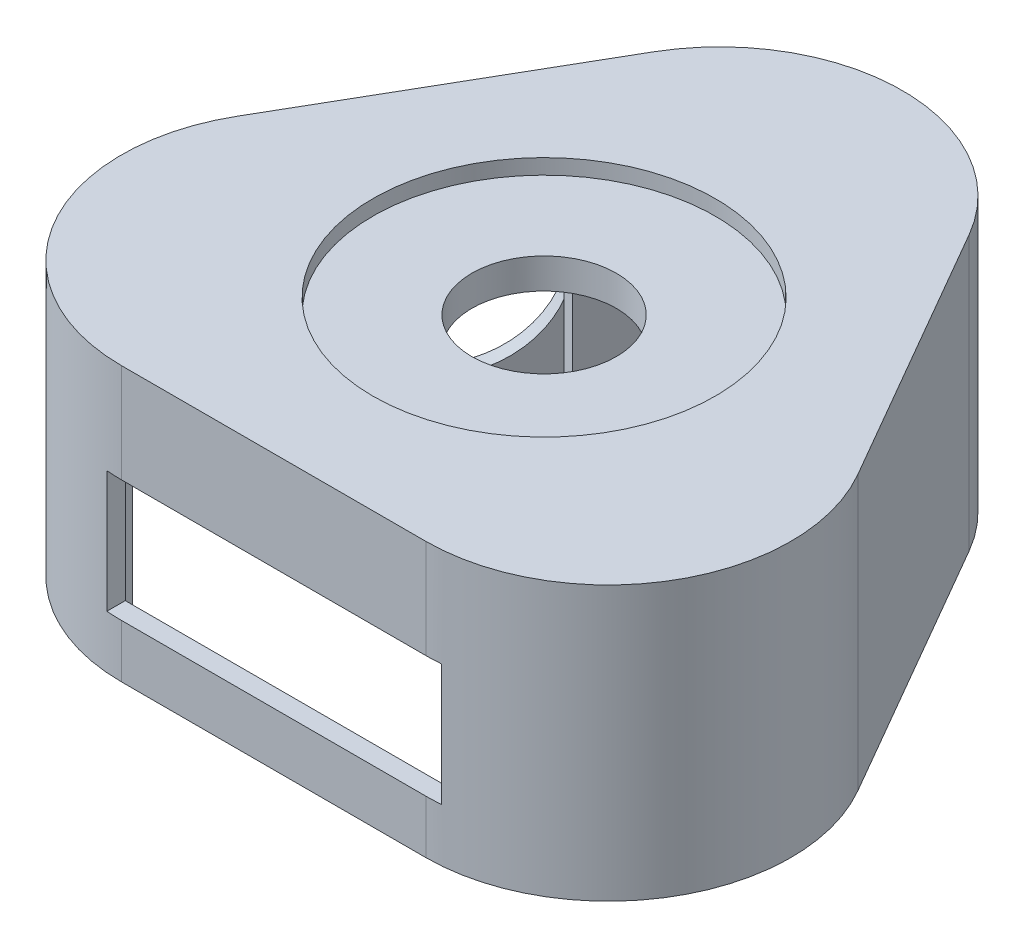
ISO-10303-21;
HEADER;
FILE_DESCRIPTION(('STEP AP214'),'2;1');
FILE_NAME('part.step','',(''),(''),'','','');
FILE_SCHEMA(('AUTOMOTIVE_DESIGN { 1 0 10303 214 1 1 1 1 }'));
ENDSEC;
DATA;
#1=APPLICATION_CONTEXT('core data for automotive mechanical design processes');
#2=APPLICATION_PROTOCOL_DEFINITION('international standard','automotive_design',2000,#1);
#3=PRODUCT_CONTEXT('',#1,'mechanical');
#4=PRODUCT('Part','Part','',(#3));
#5=PRODUCT_RELATED_PRODUCT_CATEGORY('part','',(#4));
#6=PRODUCT_DEFINITION_FORMATION('','',#4);
#7=PRODUCT_DEFINITION_CONTEXT('part definition',#1,'design');
#8=PRODUCT_DEFINITION('design','',#6,#7);
#9=PRODUCT_DEFINITION_SHAPE('','',#8);
#10=(LENGTH_UNIT() NAMED_UNIT(*) SI_UNIT(.MILLI.,.METRE.));
#11=(NAMED_UNIT(*) PLANE_ANGLE_UNIT() SI_UNIT($,.RADIAN.));
#12=(NAMED_UNIT(*) SI_UNIT($,.STERADIAN.) SOLID_ANGLE_UNIT());
#13=UNCERTAINTY_MEASURE_WITH_UNIT(LENGTH_MEASURE(1.E-05),#10,'distance_accuracy_value','');
#14=(GEOMETRIC_REPRESENTATION_CONTEXT(3) GLOBAL_UNCERTAINTY_ASSIGNED_CONTEXT((#13)) GLOBAL_UNIT_ASSIGNED_CONTEXT((#10,
#11,#12)) REPRESENTATION_CONTEXT('',''));
#15=CARTESIAN_POINT('',(0.,0.,0.));
#16=DIRECTION('',(0.,0.,1.));
#17=DIRECTION('',(1.,0.,0.));
#18=AXIS2_PLACEMENT_3D('',#15,#16,#17);
#19=CARTESIAN_POINT('',(0.,15.,-11.5470053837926));
#20=DIRECTION('',(0.,-1.,0.));
#21=DIRECTION('',(0.,0.,-1.));
#22=AXIS2_PLACEMENT_3D('',#19,#20,#21);
#23=PLANE('',#22);
#24=CARTESIAN_POINT('',(0.,15.,0.));
#25=DIRECTION('',(0.,-1.,0.));
#26=DIRECTION('',(0.,0.,-1.));
#27=AXIS2_PLACEMENT_3D('',#24,#25,#26);
#28=CIRCLE('',#27,4.75);
#29=CARTESIAN_POINT('',(0.,15.,-4.75));
#30=VERTEX_POINT('',#29);
#31=EDGE_CURVE('E493',#30,#30,#28,.T.);
#32=ORIENTED_EDGE('',*,*,#31,.F.);
#33=EDGE_LOOP('',(#32));
#34=FACE_BOUND('',#33,.T.);
#35=DIRECTION('',(-0.500000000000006,0.,0.866025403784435));
#36=VECTOR('',#35,1.);
#37=CARTESIAN_POINT('',(-8.22724133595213,15.,-16.2970053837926));
#38=LINE('',#37,#36);
#39=CARTESIAN_POINT('',(-17.2272413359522,15.,-0.708548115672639));
#40=VERTEX_POINT('',#39);
#41=CARTESIAN_POINT('',(-18.2272413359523,15.,1.02350269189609));
#42=VERTEX_POINT('',#41);
#43=EDGE_CURVE('E563',#40,#42,#38,.T.);
#44=ORIENTED_EDGE('',*,*,#43,.F.);
#45=DIRECTION('',(-0.866025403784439,0.,-0.5));
#46=VECTOR('',#45,1.);
#47=CARTESIAN_POINT('',(-17.2272413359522,15.,-0.708548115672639));
#48=LINE('',#47,#46);
#49=CARTESIAN_POINT('',(-10.9052558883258,15.,2.94145188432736));
#50=VERTEX_POINT('',#49);
#51=EDGE_CURVE('E1250',#50,#40,#48,.T.);
#52=ORIENTED_EDGE('',*,*,#51,.F.);
#53=DIRECTION('',(-0.5,0.,0.866025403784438));
#54=VECTOR('',#53,1.);
#55=CARTESIAN_POINT('',(-10.9052558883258,15.,2.94145188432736));
#56=LINE('',#55,#54);
#57=CARTESIAN_POINT('',(-8.65525588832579,15.,-0.95566243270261));
#58=VERTEX_POINT('',#57);
#59=EDGE_CURVE('E1264',#58,#50,#56,.T.);
#60=ORIENTED_EDGE('',*,*,#59,.F.);
#61=DIRECTION('',(0.866025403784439,0.,0.5));
#62=VECTOR('',#61,1.);
#63=CARTESIAN_POINT('',(-8.65525588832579,15.,-0.95566243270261));
#64=LINE('',#63,#62);
#65=CARTESIAN_POINT('',(-9.95429399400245,15.,-1.70566243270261));
#66=VERTEX_POINT('',#65);
#67=EDGE_CURVE('E1262',#66,#58,#64,.T.);
#68=ORIENTED_EDGE('',*,*,#67,.F.);
#69=DIRECTION('',(0.5,0.,-0.866025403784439));
#70=VECTOR('',#69,1.);
#71=CARTESIAN_POINT('',(-9.95429399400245,15.,-1.70566243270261));
#72=LINE('',#71,#70);
#73=CARTESIAN_POINT('',(-11.3292939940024,15.,0.675907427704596));
#74=VERTEX_POINT('',#73);
#75=EDGE_CURVE('E1256',#74,#66,#72,.T.);
#76=ORIENTED_EDGE('',*,*,#75,.F.);
#77=DIRECTION('',(0.866025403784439,0.,0.499999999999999));
#78=VECTOR('',#77,1.);
#79=CARTESIAN_POINT('',(-11.3292939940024,15.,0.675907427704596));
#80=LINE('',#79,#78);
#81=CARTESIAN_POINT('',(-14.360382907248,15.,-1.0740925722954));
#82=VERTEX_POINT('',#81);
#83=EDGE_CURVE('E1254',#82,#74,#80,.T.);
#84=ORIENTED_EDGE('',*,*,#83,.F.);
#85=DIRECTION('',(-0.499999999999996,0.,0.866025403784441));
#86=VECTOR('',#85,1.);
#87=CARTESIAN_POINT('',(-14.360382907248,15.,-1.0740925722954));
#88=LINE('',#87,#86);
#89=CARTESIAN_POINT('',(-13.985382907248,15.,-1.72361162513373));
#90=VERTEX_POINT('',#89);
#91=EDGE_CURVE('E357',#90,#82,#88,.T.);
#92=ORIENTED_EDGE('',*,*,#91,.F.);
#93=DIRECTION('',(0.86602540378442,0.,0.500000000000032));
#94=VECTOR('',#93,1.);
#95=CARTESIAN_POINT('',(-13.985382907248,15.,-1.72361162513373));
#96=LINE('',#95,#94);
#97=CARTESIAN_POINT('',(-15.9772413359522,15.,-2.87361162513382));
#98=VERTEX_POINT('',#97);
#99=EDGE_CURVE('E353',#98,#90,#96,.T.);
#100=ORIENTED_EDGE('',*,*,#99,.F.);
#101=CARTESIAN_POINT('',(-10.4772413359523,15.,-12.3998910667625));
#102=VERTEX_POINT('',#101);
#103=EDGE_CURVE('E584',#102,#98,#38,.T.);
#104=ORIENTED_EDGE('',*,*,#103,.F.);
#105=DIRECTION('',(-0.866025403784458,0.,-0.499999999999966));
#106=VECTOR('',#105,1.);
#107=CARTESIAN_POINT('',(-8.48538290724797,15.,-11.2498910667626));
#108=LINE('',#107,#106);
#109=CARTESIAN_POINT('',(-8.48538290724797,15.,-11.2498910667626));
#110=VERTEX_POINT('',#109);
#111=EDGE_CURVE('E370',#110,#102,#108,.T.);
#112=ORIENTED_EDGE('',*,*,#111,.F.);
#113=DIRECTION('',(-0.500000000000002,0.,0.866025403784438));
#114=VECTOR('',#113,1.);
#115=CARTESIAN_POINT('',(-8.11038290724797,15.,-11.8994101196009));
#116=LINE('',#115,#114);
#117=CARTESIAN_POINT('',(-8.11038290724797,15.,-11.8994101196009));
#118=VERTEX_POINT('',#117);
#119=EDGE_CURVE('E390',#118,#110,#116,.T.);
#120=ORIENTED_EDGE('',*,*,#119,.F.);
#121=DIRECTION('',(-0.866025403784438,0.,-0.500000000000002));
#122=VECTOR('',#121,1.);
#123=CARTESIAN_POINT('',(-5.07929399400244,15.,-10.1494101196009));
#124=LINE('',#123,#122);
#125=CARTESIAN_POINT('',(-5.07929399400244,15.,-10.1494101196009));
#126=VERTEX_POINT('',#125);
#127=EDGE_CURVE('E388',#126,#118,#124,.T.);
#128=ORIENTED_EDGE('',*,*,#127,.F.);
#129=DIRECTION('',(0.500000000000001,0.,-0.866025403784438));
#130=VECTOR('',#129,1.);
#131=CARTESIAN_POINT('',(-6.45429399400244,15.,-7.76784025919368));
#132=LINE('',#131,#130);
#133=CARTESIAN_POINT('',(-6.45429399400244,15.,-7.76784025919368));
#134=VERTEX_POINT('',#133);
#135=EDGE_CURVE('E386',#134,#126,#132,.T.);
#136=ORIENTED_EDGE('',*,*,#135,.F.);
#137=DIRECTION('',(-0.866025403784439,0.,-0.5));
#138=VECTOR('',#137,1.);
#139=CARTESIAN_POINT('',(-5.15525588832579,15.,-7.01784025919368));
#140=LINE('',#139,#138);
#141=CARTESIAN_POINT('',(-5.15525588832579,15.,-7.01784025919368));
#142=VERTEX_POINT('',#141);
#143=EDGE_CURVE('E384',#142,#134,#140,.T.);
#144=ORIENTED_EDGE('',*,*,#143,.F.);
#145=DIRECTION('',(-0.5,0.,0.866025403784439));
#146=VECTOR('',#145,1.);
#147=CARTESIAN_POINT('',(-2.90525588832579,15.,-10.9149545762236));
#148=LINE('',#147,#146);
#149=CARTESIAN_POINT('',(-2.90525588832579,15.,-10.9149545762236));
#150=VERTEX_POINT('',#149);
#151=EDGE_CURVE('E361',#150,#142,#148,.T.);
#152=ORIENTED_EDGE('',*,*,#151,.F.);
#153=DIRECTION('',(0.866025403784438,0.,0.5));
#154=VECTOR('',#153,1.);
#155=CARTESIAN_POINT('',(-9.22724133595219,15.,-14.5649545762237));
#156=LINE('',#155,#154);
#157=CARTESIAN_POINT('',(-9.22724133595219,15.,-14.5649545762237));
#158=VERTEX_POINT('',#157);
#159=EDGE_CURVE('E359',#158,#150,#156,.T.);
#160=ORIENTED_EDGE('',*,*,#159,.F.);
#161=CARTESIAN_POINT('',(-8.22724133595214,15.,-16.2970053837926));
#162=VERTEX_POINT('',#161);
#163=EDGE_CURVE('E580',#162,#158,#38,.T.);
#164=ORIENTED_EDGE('',*,*,#163,.F.);
#165=CARTESIAN_POINT('',(0.,15.,-11.5470053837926));
#166=DIRECTION('',(0.,-1.,0.));
#167=DIRECTION('',(0.,0.,-1.));
#168=AXIS2_PLACEMENT_3D('',#165,#166,#167);
#169=CIRCLE('',#168,9.50000000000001);
#170=CARTESIAN_POINT('',(8.22724133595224,15.,-16.2970053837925));
#171=VERTEX_POINT('',#170);
#172=EDGE_CURVE('E552',#171,#162,#169,.F.);
#173=ORIENTED_EDGE('',*,*,#172,.F.);
#174=DIRECTION('',(-0.499999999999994,0.,-0.866025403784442));
#175=VECTOR('',#174,1.);
#176=CARTESIAN_POINT('',(18.2272413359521,15.,1.02350269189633));
#177=LINE('',#176,#175);
#178=CARTESIAN_POINT('',(18.2272413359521,15.,1.02350269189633));
#179=VERTEX_POINT('',#178);
#180=EDGE_CURVE('E554',#179,#171,#177,.T.);
#181=ORIENTED_EDGE('',*,*,#180,.F.);
#182=CARTESIAN_POINT('',(9.99999999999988,15.,5.77350269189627));
#183=DIRECTION('',(0.,-1.,0.));
#184=DIRECTION('',(0.,0.,-1.));
#185=AXIS2_PLACEMENT_3D('',#182,#183,#184);
#186=CIRCLE('',#185,9.5);
#187=CARTESIAN_POINT('',(9.99999999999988,15.,15.2735026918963));
#188=VERTEX_POINT('',#187);
#189=EDGE_CURVE('E557',#188,#179,#186,.F.);
#190=ORIENTED_EDGE('',*,*,#189,.F.);
#191=DIRECTION('',(1.,0.,0.));
#192=VECTOR('',#191,1.);
#193=CARTESIAN_POINT('',(-10.0000000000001,15.,15.2735026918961));
#194=LINE('',#193,#192);
#195=CARTESIAN_POINT('',(-10.0000000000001,15.,15.2735026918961));
#196=VERTEX_POINT('',#195);
#197=EDGE_CURVE('E559',#196,#188,#194,.T.);
#198=ORIENTED_EDGE('',*,*,#197,.F.);
#199=CARTESIAN_POINT('',(-10.0000000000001,15.,5.77350269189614));
#200=DIRECTION('',(0.,-1.,0.));
#201=DIRECTION('',(0.,0.,-1.));
#202=AXIS2_PLACEMENT_3D('',#199,#200,#201);
#203=CIRCLE('',#202,9.5);
#204=EDGE_CURVE('E561',#42,#196,#203,.F.);
#205=ORIENTED_EDGE('',*,*,#204,.F.);
#206=EDGE_LOOP('',(#44,#52,#60,#68,#76,#84,#92,#100,#104,#112,#120,#128,#136,#144,#152,#160,
#164,#173,#181,#190,#198,#205));
#207=FACE_BOUND('',#206,.T.);
#208=ADVANCED_FACE('F37',(#34,#207),#23,.T.);
#209=CARTESIAN_POINT('',(-8.22724133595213,71.2933326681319,-16.2970053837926));
#210=DIRECTION('',(-0.866025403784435,0.,-0.500000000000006));
#211=DIRECTION('',(-0.500000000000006,0.,0.866025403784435));
#212=AXIS2_PLACEMENT_3D('',#209,#210,#211);
#213=PLANE('',#212);
#214=DIRECTION('',(0.,1.,0.));
#215=VECTOR('',#214,1.);
#216=CARTESIAN_POINT('',(-17.2272413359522,1.5,-0.708548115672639));
#217=LINE('',#216,#215);
#218=CARTESIAN_POINT('',(-17.2272413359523,1.5,-0.7085481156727));
#219=VERTEX_POINT('',#218);
#220=EDGE_CURVE('E52',#219,#40,#217,.T.);
#221=ORIENTED_EDGE('',*,*,#220,.T.);
#222=ORIENTED_EDGE('',*,*,#43,.T.);
#223=DIRECTION('',(0.,-1.,0.));
#224=VECTOR('',#223,1.);
#225=CARTESIAN_POINT('',(-18.2272413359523,71.2933326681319,1.02350269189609));
#226=LINE('',#225,#224);
#227=CARTESIAN_POINT('',(-18.2272413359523,1.5,1.02350269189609));
#228=VERTEX_POINT('',#227);
#229=EDGE_CURVE('E551',#42,#228,#226,.T.);
#230=ORIENTED_EDGE('',*,*,#229,.T.);
#231=DIRECTION('',(-0.500000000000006,0.,0.866025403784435));
#232=VECTOR('',#231,1.);
#233=CARTESIAN_POINT('',(-8.22724133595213,1.5,-16.2970053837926));
#234=LINE('',#233,#232);
#235=EDGE_CURVE('E632',#219,#228,#234,.T.);
#236=ORIENTED_EDGE('',*,*,#235,.F.);
#237=EDGE_LOOP('',(#221,#222,#230,#236));
#238=FACE_BOUND('',#237,.T.);
#239=ADVANCED_FACE('F671',(#238),#213,.F.);
#240=DIRECTION('',(0.,1.,0.));
#241=VECTOR('',#240,1.);
#242=CARTESIAN_POINT('',(-15.9772413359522,1.5,-2.87361162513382));
#243=LINE('',#242,#241);
#244=CARTESIAN_POINT('',(-15.9772413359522,1.5,-2.87361162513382));
#245=VERTEX_POINT('',#244);
#246=CARTESIAN_POINT('',(-15.9772413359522,8.7,-2.87361162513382));
#247=VERTEX_POINT('',#246);
#248=EDGE_CURVE('E1267',#245,#247,#243,.T.);
#249=ORIENTED_EDGE('',*,*,#248,.F.);
#250=CARTESIAN_POINT('',(-10.4772413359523,1.5,-12.3998910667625));
#251=VERTEX_POINT('',#250);
#252=EDGE_CURVE('E637',#251,#245,#234,.T.);
#253=ORIENTED_EDGE('',*,*,#252,.F.);
#254=DIRECTION('',(0.,1.,0.));
#255=VECTOR('',#254,1.);
#256=CARTESIAN_POINT('',(-10.4772413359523,1.5,-12.3998910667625));
#257=LINE('',#256,#255);
#258=CARTESIAN_POINT('',(-10.4772413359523,8.7,-12.3998910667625));
#259=VERTEX_POINT('',#258);
#260=EDGE_CURVE('E60',#251,#259,#257,.T.);
#261=ORIENTED_EDGE('',*,*,#260,.T.);
#262=CARTESIAN_POINT('',(-13.2272413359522,8.7,-7.63675134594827));
#263=DIRECTION('',(-0.866025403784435,0.,-0.500000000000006));
#264=DIRECTION('',(-0.500000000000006,0.,0.866025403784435));
#265=AXIS2_PLACEMENT_3D('',#262,#263,#264);
#266=CIRCLE('',#265,5.5);
#267=EDGE_CURVE('E494',#247,#259,#266,.F.);
#268=ORIENTED_EDGE('',*,*,#267,.F.);
#269=EDGE_LOOP('',(#249,#253,#261,#268));
#270=FACE_BOUND('',#269,.T.);
#271=ADVANCED_FACE('F677',(#270),#213,.F.);
#272=EDGE_CURVE('E1247',#247,#98,#243,.T.);
#273=ORIENTED_EDGE('',*,*,#272,.F.);
#274=EDGE_CURVE('E490',#259,#247,#266,.F.);
#275=ORIENTED_EDGE('',*,*,#274,.F.);
#276=EDGE_CURVE('E381',#259,#102,#257,.T.);
#277=ORIENTED_EDGE('',*,*,#276,.T.);
#278=ORIENTED_EDGE('',*,*,#103,.T.);
#279=EDGE_LOOP('',(#273,#275,#277,#278));
#280=FACE_BOUND('',#279,.T.);
#281=ADVANCED_FACE('F707',(#280),#213,.F.);
#282=DIRECTION('',(0.,1.,0.));
#283=VECTOR('',#282,1.);
#284=CARTESIAN_POINT('',(-9.22724133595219,1.5,-14.5649545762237));
#285=LINE('',#284,#283);
#286=CARTESIAN_POINT('',(-9.22724133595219,1.5,-14.5649545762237));
#287=VERTEX_POINT('',#286);
#288=EDGE_CURVE('E412',#287,#158,#285,.T.);
#289=ORIENTED_EDGE('',*,*,#288,.F.);
#290=CARTESIAN_POINT('',(-8.22724133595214,1.5,-16.2970053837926));
#291=VERTEX_POINT('',#290);
#292=EDGE_CURVE('E633',#291,#287,#234,.T.);
#293=ORIENTED_EDGE('',*,*,#292,.F.);
#294=DIRECTION('',(0.,-1.,0.));
#295=VECTOR('',#294,1.);
#296=CARTESIAN_POINT('',(-8.22724133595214,71.2933326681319,-16.2970053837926));
#297=LINE('',#296,#295);
#298=EDGE_CURVE('E575',#162,#291,#297,.T.);
#299=ORIENTED_EDGE('',*,*,#298,.F.);
#300=ORIENTED_EDGE('',*,*,#163,.T.);
#301=EDGE_LOOP('',(#289,#293,#299,#300));
#302=FACE_BOUND('',#301,.T.);
#303=ADVANCED_FACE('F680',(#302),#213,.F.);
#304=CARTESIAN_POINT('',(-11.0000000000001,3.5,-23.5480053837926));
#305=DIRECTION('',(0.,-1.,0.));
#306=DIRECTION('',(0.,0.,-1.));
#307=AXIS2_PLACEMENT_3D('',#304,#305,#306);
#308=PLANE('',#307);
#309=DIRECTION('',(1.,0.,0.));
#310=VECTOR('',#309,1.);
#311=CARTESIAN_POINT('',(-11.0000000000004,3.5,16.5235026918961));
#312=LINE('',#311,#310);
#313=CARTESIAN_POINT('',(-11.0000000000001,3.5,16.5235026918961));
#314=VERTEX_POINT('',#313);
#315=CARTESIAN_POINT('',(10.9999999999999,3.5,16.5235026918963));
#316=VERTEX_POINT('',#315);
#317=EDGE_CURVE('E444',#314,#316,#312,.T.);
#318=ORIENTED_EDGE('',*,*,#317,.F.);
#319=DIRECTION('',(0.,0.,1.));
#320=VECTOR('',#319,1.);
#321=CARTESIAN_POINT('',(-11.0000000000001,3.5,-23.5480053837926));
#322=LINE('',#321,#320);
#323=CARTESIAN_POINT('',(-11.0000000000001,3.5,17.7317634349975));
#324=VERTEX_POINT('',#323);
#325=EDGE_CURVE('E475',#314,#324,#322,.T.);
#326=ORIENTED_EDGE('',*,*,#325,.T.);
#327=CARTESIAN_POINT('',(-10.0000000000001,3.5,5.77350269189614));
#328=DIRECTION('',(0.,-1.,0.));
#329=DIRECTION('',(0.,0.,-1.));
#330=AXIS2_PLACEMENT_3D('',#327,#328,#329);
#331=CIRCLE('',#330,12.);
#332=CARTESIAN_POINT('',(-10.0000000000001,3.5,17.7735026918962));
#333=VERTEX_POINT('',#332);
#334=EDGE_CURVE('E467',#324,#333,#331,.F.);
#335=ORIENTED_EDGE('',*,*,#334,.T.);
#336=DIRECTION('',(1.,0.,0.));
#337=VECTOR('',#336,1.);
#338=CARTESIAN_POINT('',(-11.0000000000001,3.5,17.7735026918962));
#339=LINE('',#338,#337);
#340=CARTESIAN_POINT('',(9.9999999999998,3.5,17.7735026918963));
#341=VERTEX_POINT('',#340);
#342=EDGE_CURVE('E455',#333,#341,#339,.T.);
#343=ORIENTED_EDGE('',*,*,#342,.T.);
#344=CARTESIAN_POINT('',(9.99999999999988,3.5,5.77350269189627));
#345=DIRECTION('',(0.,-1.,0.));
#346=DIRECTION('',(0.,0.,-1.));
#347=AXIS2_PLACEMENT_3D('',#344,#345,#346);
#348=CIRCLE('',#347,12.);
#349=CARTESIAN_POINT('',(10.9999999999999,3.5,17.7317634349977));
#350=VERTEX_POINT('',#349);
#351=EDGE_CURVE('E464',#341,#350,#348,.F.);
#352=ORIENTED_EDGE('',*,*,#351,.T.);
#353=DIRECTION('',(0.,0.,1.));
#354=VECTOR('',#353,1.);
#355=CARTESIAN_POINT('',(10.9999999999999,3.5,-23.5480053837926));
#356=LINE('',#355,#354);
#357=EDGE_CURVE('E458',#316,#350,#356,.T.);
#358=ORIENTED_EDGE('',*,*,#357,.F.);
#359=EDGE_LOOP('',(#318,#326,#335,#343,#352,#358));
#360=FACE_BOUND('',#359,.T.);
#361=ADVANCED_FACE('F706',(#360),#308,.F.);
#362=CARTESIAN_POINT('',(10.9999999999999,11.5,-23.5480053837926));
#363=DIRECTION('',(1.,0.,0.));
#364=DIRECTION('',(0.,0.,-1.));
#365=AXIS2_PLACEMENT_3D('',#362,#363,#364);
#366=PLANE('',#365);
#367=DIRECTION('',(0.,1.,0.));
#368=VECTOR('',#367,1.);
#369=CARTESIAN_POINT('',(10.9999999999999,11.5,16.5235026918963));
#370=LINE('',#369,#368);
#371=CARTESIAN_POINT('',(10.9999999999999,11.5,16.5235026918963));
#372=VERTEX_POINT('',#371);
#373=EDGE_CURVE('E442',#316,#372,#370,.T.);
#374=ORIENTED_EDGE('',*,*,#373,.F.);
#375=ORIENTED_EDGE('',*,*,#357,.T.);
#376=DIRECTION('',(0.,-1.,0.));
#377=VECTOR('',#376,1.);
#378=CARTESIAN_POINT('',(10.9999999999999,18.,17.7317634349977));
#379=LINE('',#378,#377);
#380=CARTESIAN_POINT('',(10.9999999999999,11.5,17.7317634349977));
#381=VERTEX_POINT('',#380);
#382=EDGE_CURVE('E472',#350,#381,#379,.F.);
#383=ORIENTED_EDGE('',*,*,#382,.T.);
#384=DIRECTION('',(0.,0.,1.));
#385=VECTOR('',#384,1.);
#386=CARTESIAN_POINT('',(10.9999999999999,11.5,-23.5480053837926));
#387=LINE('',#386,#385);
#388=EDGE_CURVE('E480',#372,#381,#387,.T.);
#389=ORIENTED_EDGE('',*,*,#388,.F.);
#390=EDGE_LOOP('',(#374,#375,#383,#389));
#391=FACE_BOUND('',#390,.T.);
#392=ADVANCED_FACE('F785',(#391),#366,.F.);
#393=CARTESIAN_POINT('',(-11.0000000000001,11.5,-23.5480053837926));
#394=DIRECTION('',(0.,1.,0.));
#395=DIRECTION('',(0.,0.,1.));
#396=AXIS2_PLACEMENT_3D('',#393,#394,#395);
#397=PLANE('',#396);
#398=DIRECTION('',(-1.,0.,0.));
#399=VECTOR('',#398,1.);
#400=CARTESIAN_POINT('',(-11.0000000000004,11.5,16.5235026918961));
#401=LINE('',#400,#399);
#402=CARTESIAN_POINT('',(-11.0000000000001,11.5,16.5235026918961));
#403=VERTEX_POINT('',#402);
#404=EDGE_CURVE('E431',#372,#403,#401,.T.);
#405=ORIENTED_EDGE('',*,*,#404,.F.);
#406=ORIENTED_EDGE('',*,*,#388,.T.);
#407=CARTESIAN_POINT('',(9.99999999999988,11.5,5.77350269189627));
#408=DIRECTION('',(0.,1.,0.));
#409=DIRECTION('',(0.,0.,1.));
#410=AXIS2_PLACEMENT_3D('',#407,#408,#409);
#411=CIRCLE('',#410,12.);
#412=CARTESIAN_POINT('',(9.99999999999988,11.5,17.7735026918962));
#413=VERTEX_POINT('',#412);
#414=EDGE_CURVE('E470',#381,#413,#411,.F.);
#415=ORIENTED_EDGE('',*,*,#414,.T.);
#416=DIRECTION('',(-1.,0.,0.));
#417=VECTOR('',#416,1.);
#418=CARTESIAN_POINT('',(-11.0000000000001,11.5,17.7735026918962));
#419=LINE('',#418,#417);
#420=CARTESIAN_POINT('',(-10.0000000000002,11.5,17.7735026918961));
#421=VERTEX_POINT('',#420);
#422=EDGE_CURVE('E456',#413,#421,#419,.T.);
#423=ORIENTED_EDGE('',*,*,#422,.T.);
#424=CARTESIAN_POINT('',(-10.0000000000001,11.5,5.77350269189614));
#425=DIRECTION('',(0.,1.,0.));
#426=DIRECTION('',(0.,0.,1.));
#427=AXIS2_PLACEMENT_3D('',#424,#425,#426);
#428=CIRCLE('',#427,12.);
#429=CARTESIAN_POINT('',(-11.0000000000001,11.5,17.7317634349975));
#430=VERTEX_POINT('',#429);
#431=EDGE_CURVE('E460',#421,#430,#428,.F.);
#432=ORIENTED_EDGE('',*,*,#431,.T.);
#433=DIRECTION('',(0.,0.,1.));
#434=VECTOR('',#433,1.);
#435=CARTESIAN_POINT('',(-11.0000000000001,11.5,-23.5480053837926));
#436=LINE('',#435,#434);
#437=EDGE_CURVE('E478',#403,#430,#436,.T.);
#438=ORIENTED_EDGE('',*,*,#437,.F.);
#439=EDGE_LOOP('',(#405,#406,#415,#423,#432,#438));
#440=FACE_BOUND('',#439,.T.);
#441=ADVANCED_FACE('F780',(#440),#397,.F.);
#442=CARTESIAN_POINT('',(-11.0000000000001,11.5,-23.5480053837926));
#443=DIRECTION('',(-1.,0.,0.));
#444=DIRECTION('',(0.,0.,1.));
#445=AXIS2_PLACEMENT_3D('',#442,#443,#444);
#446=PLANE('',#445);
#447=DIRECTION('',(0.,-1.,0.));
#448=VECTOR('',#447,1.);
#449=CARTESIAN_POINT('',(-11.0000000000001,11.5,16.5235026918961));
#450=LINE('',#449,#448);
#451=EDGE_CURVE('E636',#403,#314,#450,.T.);
#452=ORIENTED_EDGE('',*,*,#451,.F.);
#453=ORIENTED_EDGE('',*,*,#437,.T.);
#454=DIRECTION('',(0.,-1.,0.));
#455=VECTOR('',#454,1.);
#456=CARTESIAN_POINT('',(-11.0000000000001,18.,17.7317634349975));
#457=LINE('',#456,#455);
#458=EDGE_CURVE('E463',#430,#324,#457,.T.);
#459=ORIENTED_EDGE('',*,*,#458,.T.);
#460=ORIENTED_EDGE('',*,*,#325,.F.);
#461=EDGE_LOOP('',(#452,#453,#459,#460));
#462=FACE_BOUND('',#461,.T.);
#463=ADVANCED_FACE('F793',(#462),#446,.F.);
#464=CARTESIAN_POINT('',(9.9999999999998,18.,17.7735026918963));
#465=DIRECTION('',(0.,0.,-1.));
#466=DIRECTION('',(-1.,0.,0.));
#467=AXIS2_PLACEMENT_3D('',#464,#465,#466);
#468=PLANE('',#467);
#469=DIRECTION('',(0.,-1.,0.));
#470=VECTOR('',#469,1.);
#471=CARTESIAN_POINT('',(9.9999999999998,18.,17.7735026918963));
#472=LINE('',#471,#470);
#473=CARTESIAN_POINT('',(9.9999999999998,0.,17.7735026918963));
#474=VERTEX_POINT('',#473);
#475=EDGE_CURVE('E618',#341,#474,#472,.T.);
#476=ORIENTED_EDGE('',*,*,#475,.F.);
#477=ORIENTED_EDGE('',*,*,#342,.F.);
#478=DIRECTION('',(0.,-1.,0.));
#479=VECTOR('',#478,1.);
#480=CARTESIAN_POINT('',(-10.0000000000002,18.,17.7735026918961));
#481=LINE('',#480,#479);
#482=CARTESIAN_POINT('',(-10.0000000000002,0.,17.7735026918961));
#483=VERTEX_POINT('',#482);
#484=EDGE_CURVE('E622',#333,#483,#481,.T.);
#485=ORIENTED_EDGE('',*,*,#484,.T.);
#486=DIRECTION('',(1.,0.,0.));
#487=VECTOR('',#486,1.);
#488=CARTESIAN_POINT('',(9.9999999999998,0.,17.7735026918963));
#489=LINE('',#488,#487);
#490=EDGE_CURVE('E607',#483,#474,#489,.T.);
#491=ORIENTED_EDGE('',*,*,#490,.T.);
#492=EDGE_LOOP('',(#476,#477,#485,#491));
#493=FACE_BOUND('',#492,.T.);
#494=ADVANCED_FACE('F733',(#493),#468,.F.);
#495=CARTESIAN_POINT('',(0.,18.,0.));
#496=DIRECTION('',(0.,-1.,0.));
#497=DIRECTION('',(0.,0.,-1.));
#498=AXIS2_PLACEMENT_3D('',#495,#496,#497);
#499=CYLINDRICAL_SURFACE('',#498,4.75);
#500=ORIENTED_EDGE('',*,*,#31,.T.);
#501=EDGE_LOOP('',(#500));
#502=FACE_BOUND('',#501,.T.);
#503=CARTESIAN_POINT('',(0.,17.,0.));
#504=DIRECTION('',(0.,1.,0.));
#505=DIRECTION('',(0.,0.,1.));
#506=AXIS2_PLACEMENT_3D('',#503,#504,#505);
#507=CIRCLE('',#506,4.75);
#508=CARTESIAN_POINT('',(0.,17.,4.75));
#509=VERTEX_POINT('',#508);
#510=EDGE_CURVE('E487',#509,#509,#507,.F.);
#511=ORIENTED_EDGE('',*,*,#510,.F.);
#512=EDGE_LOOP('',(#511));
#513=FACE_BOUND('',#512,.T.);
#514=ADVANCED_FACE('F742',(#502,#513),#499,.F.);
#515=CARTESIAN_POINT('',(0.,18.,-11.5470053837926));
#516=DIRECTION('',(0.,-1.,0.));
#517=DIRECTION('',(0.,0.,-1.));
#518=AXIS2_PLACEMENT_3D('',#515,#516,#517);
#519=CYLINDRICAL_SURFACE('',#518,12.);
#520=CARTESIAN_POINT('',(0.,0.,-11.5470053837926));
#521=DIRECTION('',(0.,1.,0.));
#522=DIRECTION('',(0.,0.,-1.));
#523=AXIS2_PLACEMENT_3D('',#520,#521,#522);
#524=CIRCLE('',#523,12.);
#525=CARTESIAN_POINT('',(10.3923048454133,0.,-17.5470053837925));
#526=VERTEX_POINT('',#525);
#527=CARTESIAN_POINT('',(-10.3923048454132,0.,-17.5470053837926));
#528=VERTEX_POINT('',#527);
#529=EDGE_CURVE('E583',#526,#528,#524,.T.);
#530=ORIENTED_EDGE('',*,*,#529,.T.);
#531=DIRECTION('',(0.,-1.,0.));
#532=VECTOR('',#531,1.);
#533=CARTESIAN_POINT('',(-10.3923048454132,18.,-17.5470053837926));
#534=LINE('',#533,#532);
#535=CARTESIAN_POINT('',(-10.3923048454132,18.,-17.5470053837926));
#536=VERTEX_POINT('',#535);
#537=EDGE_CURVE('E629',#536,#528,#534,.T.);
#538=ORIENTED_EDGE('',*,*,#537,.F.);
#539=CARTESIAN_POINT('',(0.,18.,-11.5470053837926));
#540=DIRECTION('',(0.,1.,0.));
#541=DIRECTION('',(0.,0.,-1.));
#542=AXIS2_PLACEMENT_3D('',#539,#540,#541);
#543=CIRCLE('',#542,12.);
#544=CARTESIAN_POINT('',(10.3923048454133,18.,-17.5470053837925));
#545=VERTEX_POINT('',#544);
#546=EDGE_CURVE('E585',#545,#536,#543,.T.);
#547=ORIENTED_EDGE('',*,*,#546,.F.);
#548=DIRECTION('',(0.,-1.,0.));
#549=VECTOR('',#548,1.);
#550=CARTESIAN_POINT('',(10.3923048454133,18.,-17.5470053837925));
#551=LINE('',#550,#549);
#552=EDGE_CURVE('E599',#545,#526,#551,.T.);
#553=ORIENTED_EDGE('',*,*,#552,.T.);
#554=EDGE_LOOP('',(#530,#538,#547,#553));
#555=FACE_BOUND('',#554,.T.);
#556=ADVANCED_FACE('F739',(#555),#519,.T.);
#557=CARTESIAN_POINT('',(-10.3923048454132,18.,-17.5470053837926));
#558=DIRECTION('',(0.866025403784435,0.,0.500000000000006));
#559=DIRECTION('',(0.500000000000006,0.,-0.866025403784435));
#560=AXIS2_PLACEMENT_3D('',#557,#558,#559);
#561=PLANE('',#560);
#562=CARTESIAN_POINT('',(-15.3923048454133,8.7,-8.88675134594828));
#563=DIRECTION('',(0.866025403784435,0.,0.500000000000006));
#564=DIRECTION('',(0.500000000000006,0.,-0.866025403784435));
#565=AXIS2_PLACEMENT_3D('',#562,#563,#564);
#566=CIRCLE('',#565,7.00000000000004);
#567=CARTESIAN_POINT('',(-18.8923048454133,8.7,-2.8245735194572));
#568=VERTEX_POINT('',#567);
#569=EDGE_CURVE('E12',#568,#568,#566,.T.);
#570=ORIENTED_EDGE('',*,*,#569,.T.);
#571=EDGE_LOOP('',(#570));
#572=FACE_BOUND('',#571,.T.);
#573=DIRECTION('',(-0.500000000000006,0.,0.866025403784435));
#574=VECTOR('',#573,1.);
#575=CARTESIAN_POINT('',(-10.3923048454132,0.,-17.5470053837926));
#576=LINE('',#575,#574);
#577=CARTESIAN_POINT('',(-20.3923048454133,0.,-0.226497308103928));
#578=VERTEX_POINT('',#577);
#579=EDGE_CURVE('E602',#528,#578,#576,.T.);
#580=ORIENTED_EDGE('',*,*,#579,.T.);
#581=DIRECTION('',(0.,-1.,0.));
#582=VECTOR('',#581,1.);
#583=CARTESIAN_POINT('',(-20.3923048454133,18.,-0.226497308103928));
#584=LINE('',#583,#582);
#585=CARTESIAN_POINT('',(-20.3923048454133,18.,-0.226497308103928));
#586=VERTEX_POINT('',#585);
#587=EDGE_CURVE('E626',#586,#578,#584,.T.);
#588=ORIENTED_EDGE('',*,*,#587,.F.);
#589=DIRECTION('',(-0.500000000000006,0.,0.866025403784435));
#590=VECTOR('',#589,1.);
#591=CARTESIAN_POINT('',(-10.3923048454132,18.,-17.5470053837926));
#592=LINE('',#591,#590);
#593=EDGE_CURVE('E588',#536,#586,#592,.T.);
#594=ORIENTED_EDGE('',*,*,#593,.F.);
#595=ORIENTED_EDGE('',*,*,#537,.T.);
#596=EDGE_LOOP('',(#580,#588,#594,#595));
#597=FACE_BOUND('',#596,.T.);
#598=ADVANCED_FACE('F736',(#572,#597),#561,.F.);
#599=CARTESIAN_POINT('',(-10.0000000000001,18.,5.77350269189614));
#600=DIRECTION('',(0.,-1.,0.));
#601=DIRECTION('',(0.,0.,-1.));
#602=AXIS2_PLACEMENT_3D('',#599,#600,#601);
#603=CYLINDRICAL_SURFACE('',#602,12.);
#604=ORIENTED_EDGE('',*,*,#484,.F.);
#605=ORIENTED_EDGE('',*,*,#334,.F.);
#606=ORIENTED_EDGE('',*,*,#458,.F.);
#607=ORIENTED_EDGE('',*,*,#431,.F.);
#608=CARTESIAN_POINT('',(-10.0000000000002,18.,17.7735026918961));
#609=VERTEX_POINT('',#608);
#610=EDGE_CURVE('E623',#609,#421,#481,.T.);
#611=ORIENTED_EDGE('',*,*,#610,.F.);
#612=CARTESIAN_POINT('',(-10.0000000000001,18.,5.77350269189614));
#613=DIRECTION('',(0.,1.,0.));
#614=DIRECTION('',(0.,0.,1.));
#615=AXIS2_PLACEMENT_3D('',#612,#613,#614);
#616=CIRCLE('',#615,12.);
#617=EDGE_CURVE('E591',#586,#609,#616,.T.);
#618=ORIENTED_EDGE('',*,*,#617,.F.);
#619=ORIENTED_EDGE('',*,*,#587,.T.);
#620=CARTESIAN_POINT('',(-10.0000000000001,0.,5.77350269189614));
#621=DIRECTION('',(0.,1.,0.));
#622=DIRECTION('',(0.,0.,1.));
#623=AXIS2_PLACEMENT_3D('',#620,#621,#622);
#624=CIRCLE('',#623,12.);
#625=EDGE_CURVE('E604',#578,#483,#624,.T.);
#626=ORIENTED_EDGE('',*,*,#625,.T.);
#627=EDGE_LOOP('',(#604,#605,#606,#607,#611,#618,#619,#626));
#628=FACE_BOUND('',#627,.T.);
#629=ADVANCED_FACE('F731',(#628),#603,.T.);
#630=ORIENTED_EDGE('',*,*,#610,.T.);
#631=ORIENTED_EDGE('',*,*,#422,.F.);
#632=CARTESIAN_POINT('',(9.9999999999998,18.,17.7735026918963));
#633=VERTEX_POINT('',#632);
#634=EDGE_CURVE('E619',#633,#413,#472,.T.);
#635=ORIENTED_EDGE('',*,*,#634,.F.);
#636=DIRECTION('',(1.,0.,0.));
#637=VECTOR('',#636,1.);
#638=CARTESIAN_POINT('',(9.9999999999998,18.,17.7735026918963));
#639=LINE('',#638,#637);
#640=EDGE_CURVE('E593',#609,#633,#639,.T.);
#641=ORIENTED_EDGE('',*,*,#640,.F.);
#642=EDGE_LOOP('',(#630,#631,#635,#641));
#643=FACE_BOUND('',#642,.T.);
#644=ADVANCED_FACE('F727',(#643),#468,.F.);
#645=CARTESIAN_POINT('',(9.99999999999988,18.,5.77350269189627));
#646=DIRECTION('',(0.,-1.,0.));
#647=DIRECTION('',(0.,0.,-1.));
#648=AXIS2_PLACEMENT_3D('',#645,#646,#647);
#649=CYLINDRICAL_SURFACE('',#648,12.);
#650=ORIENTED_EDGE('',*,*,#382,.F.);
#651=ORIENTED_EDGE('',*,*,#351,.F.);
#652=ORIENTED_EDGE('',*,*,#475,.T.);
#653=CARTESIAN_POINT('',(9.99999999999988,0.,5.77350269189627));
#654=DIRECTION('',(0.,1.,0.));
#655=DIRECTION('',(0.,0.,-1.));
#656=AXIS2_PLACEMENT_3D('',#653,#654,#655);
#657=CIRCLE('',#656,12.);
#658=CARTESIAN_POINT('',(20.3923048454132,0.,-0.226497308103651));
#659=VERTEX_POINT('',#658);
#660=EDGE_CURVE('E610',#474,#659,#657,.T.);
#661=ORIENTED_EDGE('',*,*,#660,.T.);
#662=DIRECTION('',(0.,-1.,0.));
#663=VECTOR('',#662,1.);
#664=CARTESIAN_POINT('',(20.3923048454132,18.,-0.226497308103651));
#665=LINE('',#664,#663);
#666=CARTESIAN_POINT('',(20.3923048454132,18.,-0.226497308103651));
#667=VERTEX_POINT('',#666);
#668=EDGE_CURVE('E615',#667,#659,#665,.T.);
#669=ORIENTED_EDGE('',*,*,#668,.F.);
#670=CARTESIAN_POINT('',(9.99999999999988,18.,5.77350269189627));
#671=DIRECTION('',(0.,1.,0.));
#672=DIRECTION('',(0.,0.,-1.));
#673=AXIS2_PLACEMENT_3D('',#670,#671,#672);
#674=CIRCLE('',#673,12.);
#675=EDGE_CURVE('E595',#633,#667,#674,.T.);
#676=ORIENTED_EDGE('',*,*,#675,.F.);
#677=ORIENTED_EDGE('',*,*,#634,.T.);
#678=ORIENTED_EDGE('',*,*,#414,.F.);
#679=EDGE_LOOP('',(#650,#651,#652,#661,#669,#676,#677,#678));
#680=FACE_BOUND('',#679,.T.);
#681=ADVANCED_FACE('F723',(#680),#649,.T.);
#682=CARTESIAN_POINT('',(10.3923048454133,18.,-17.5470053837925));
#683=DIRECTION('',(-0.866025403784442,0.,0.499999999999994));
#684=DIRECTION('',(0.499999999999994,0.,0.866025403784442));
#685=AXIS2_PLACEMENT_3D('',#682,#683,#684);
#686=PLANE('',#685);
#687=DIRECTION('',(-0.499999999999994,0.,-0.866025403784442));
#688=VECTOR('',#687,1.);
#689=CARTESIAN_POINT('',(10.3923048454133,0.,-17.5470053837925));
#690=LINE('',#689,#688);
#691=EDGE_CURVE('E589',#659,#526,#690,.T.);
#692=ORIENTED_EDGE('',*,*,#691,.T.);
#693=ORIENTED_EDGE('',*,*,#552,.F.);
#694=DIRECTION('',(-0.499999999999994,0.,-0.866025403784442));
#695=VECTOR('',#694,1.);
#696=CARTESIAN_POINT('',(10.3923048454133,18.,-17.5470053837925));
#697=LINE('',#696,#695);
#698=EDGE_CURVE('E597',#667,#545,#697,.T.);
#699=ORIENTED_EDGE('',*,*,#698,.F.);
#700=ORIENTED_EDGE('',*,*,#668,.T.);
#701=EDGE_LOOP('',(#692,#693,#699,#700));
#702=FACE_BOUND('',#701,.T.);
#703=ADVANCED_FACE('F716',(#702),#686,.F.);
#704=CARTESIAN_POINT('',(0.,18.,-11.5470053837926));
#705=DIRECTION('',(0.,-1.,0.));
#706=DIRECTION('',(0.,0.,-1.));
#707=AXIS2_PLACEMENT_3D('',#704,#705,#706);
#708=PLANE('',#707);
#709=CARTESIAN_POINT('',(0.,18.,0.));
#710=DIRECTION('',(0.,1.,0.));
#711=DIRECTION('',(0.,0.,1.));
#712=AXIS2_PLACEMENT_3D('',#709,#710,#711);
#713=CIRCLE('',#712,11.25);
#714=CARTESIAN_POINT('',(0.,18.,11.25));
#715=VERTEX_POINT('',#714);
#716=EDGE_CURVE('E469',#715,#715,#713,.T.);
#717=ORIENTED_EDGE('',*,*,#716,.F.);
#718=EDGE_LOOP('',(#717));
#719=FACE_BOUND('',#718,.T.);
#720=ORIENTED_EDGE('',*,*,#546,.T.);
#721=ORIENTED_EDGE('',*,*,#593,.T.);
#722=ORIENTED_EDGE('',*,*,#617,.T.);
#723=ORIENTED_EDGE('',*,*,#640,.T.);
#724=ORIENTED_EDGE('',*,*,#675,.T.);
#725=ORIENTED_EDGE('',*,*,#698,.T.);
#726=EDGE_LOOP('',(#720,#721,#722,#723,#724,#725));
#727=FACE_BOUND('',#726,.T.);
#728=ADVANCED_FACE('F712',(#719,#727),#708,.F.);
#729=CARTESIAN_POINT('',(0.,0.,-11.5470053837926));
#730=DIRECTION('',(0.,-1.,0.));
#731=DIRECTION('',(0.,0.,-1.));
#732=AXIS2_PLACEMENT_3D('',#729,#730,#731);
#733=PLANE('',#732);
#734=CARTESIAN_POINT('',(0.,0.,-11.5470053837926));
#735=DIRECTION('',(0.,-1.,0.));
#736=DIRECTION('',(0.,0.,-1.));
#737=AXIS2_PLACEMENT_3D('',#734,#735,#736);
#738=CIRCLE('',#737,10.75);
#739=CARTESIAN_POINT('',(-9.30977309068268,0.,-16.9220053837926));
#740=VERTEX_POINT('',#739);
#741=CARTESIAN_POINT('',(9.30977309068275,0.,-16.9220053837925));
#742=VERTEX_POINT('',#741);
#743=EDGE_CURVE('E497',#740,#742,#738,.T.);
#744=ORIENTED_EDGE('',*,*,#743,.F.);
#745=DIRECTION('',(0.500000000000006,0.,-0.866025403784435));
#746=VECTOR('',#745,1.);
#747=CARTESIAN_POINT('',(-19.3097730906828,0.,0.39850269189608));
#748=LINE('',#747,#746);
#749=CARTESIAN_POINT('',(-19.3097730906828,0.,0.398502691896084));
#750=VERTEX_POINT('',#749);
#751=EDGE_CURVE('E502',#750,#740,#748,.T.);
#752=ORIENTED_EDGE('',*,*,#751,.F.);
#753=CARTESIAN_POINT('',(-10.0000000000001,0.,5.77350269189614));
#754=DIRECTION('',(0.,-1.,0.));
#755=DIRECTION('',(0.,0.,-1.));
#756=AXIS2_PLACEMENT_3D('',#753,#754,#755);
#757=CIRCLE('',#756,10.75);
#758=CARTESIAN_POINT('',(-10.0000000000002,0.,16.5235026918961));
#759=VERTEX_POINT('',#758);
#760=EDGE_CURVE('E525',#759,#750,#757,.T.);
#761=ORIENTED_EDGE('',*,*,#760,.F.);
#762=DIRECTION('',(-1.,0.,0.));
#763=VECTOR('',#762,1.);
#764=CARTESIAN_POINT('',(9.99999999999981,0.,16.5235026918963));
#765=LINE('',#764,#763);
#766=CARTESIAN_POINT('',(9.99999999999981,0.,16.5235026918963));
#767=VERTEX_POINT('',#766);
#768=EDGE_CURVE('E522',#767,#759,#765,.T.);
#769=ORIENTED_EDGE('',*,*,#768,.F.);
#770=CARTESIAN_POINT('',(9.99999999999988,0.,5.77350269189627));
#771=DIRECTION('',(0.,-1.,0.));
#772=DIRECTION('',(0.,0.,-1.));
#773=AXIS2_PLACEMENT_3D('',#770,#771,#772);
#774=CIRCLE('',#773,10.75);
#775=CARTESIAN_POINT('',(19.3097730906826,0.,0.398502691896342));
#776=VERTEX_POINT('',#775);
#777=EDGE_CURVE('E519',#776,#767,#774,.T.);
#778=ORIENTED_EDGE('',*,*,#777,.F.);
#779=DIRECTION('',(0.499999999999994,0.,0.866025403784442));
#780=VECTOR('',#779,1.);
#781=CARTESIAN_POINT('',(9.30977309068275,0.,-16.9220053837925));
#782=LINE('',#781,#780);
#783=EDGE_CURVE('E516',#742,#776,#782,.T.);
#784=ORIENTED_EDGE('',*,*,#783,.F.);
#785=EDGE_LOOP('',(#744,#752,#761,#769,#778,#784));
#786=FACE_BOUND('',#785,.T.);
#787=ORIENTED_EDGE('',*,*,#529,.F.);
#788=ORIENTED_EDGE('',*,*,#691,.F.);
#789=ORIENTED_EDGE('',*,*,#660,.F.);
#790=ORIENTED_EDGE('',*,*,#490,.F.);
#791=ORIENTED_EDGE('',*,*,#625,.F.);
#792=ORIENTED_EDGE('',*,*,#579,.F.);
#793=EDGE_LOOP('',(#787,#788,#789,#790,#791,#792));
#794=FACE_BOUND('',#793,.T.);
#795=ADVANCED_FACE('F715',(#786,#794),#733,.T.);
#796=CARTESIAN_POINT('',(0.,1.5,-11.5470053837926));
#797=DIRECTION('',(0.,-1.,0.));
#798=DIRECTION('',(0.,0.,-1.));
#799=AXIS2_PLACEMENT_3D('',#796,#797,#798);
#800=PLANE('',#799);
#801=DIRECTION('',(0.,0.,-1.));
#802=VECTOR('',#801,1.);
#803=CARTESIAN_POINT('',(-12.0000000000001,1.5,16.5235026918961));
#804=LINE('',#803,#802);
#805=CARTESIAN_POINT('',(-12.0000000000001,1.5,16.3358177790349));
#806=VERTEX_POINT('',#805);
#807=CARTESIAN_POINT('',(-12.0000000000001,1.5,15.0605905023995));
#808=VERTEX_POINT('',#807);
#809=EDGE_CURVE('E432',#806,#808,#804,.T.);
#810=ORIENTED_EDGE('',*,*,#809,.F.);
#811=CARTESIAN_POINT('',(-10.0000000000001,1.5,5.77350269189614));
#812=DIRECTION('',(0.,-1.,0.));
#813=DIRECTION('',(0.,0.,-1.));
#814=AXIS2_PLACEMENT_3D('',#811,#812,#813);
#815=CIRCLE('',#814,10.75);
#816=CARTESIAN_POINT('',(-19.3097730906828,1.5,0.398502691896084));
#817=VERTEX_POINT('',#816);
#818=EDGE_CURVE('E508',#806,#817,#815,.T.);
#819=ORIENTED_EDGE('',*,*,#818,.T.);
#820=DIRECTION('',(0.500000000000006,0.,-0.866025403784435));
#821=VECTOR('',#820,1.);
#822=CARTESIAN_POINT('',(-19.3097730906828,1.5,0.39850269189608));
#823=LINE('',#822,#821);
#824=CARTESIAN_POINT('',(-9.30977309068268,1.5,-16.9220053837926));
#825=VERTEX_POINT('',#824);
#826=EDGE_CURVE('E511',#817,#825,#823,.T.);
#827=ORIENTED_EDGE('',*,*,#826,.T.);
#828=CARTESIAN_POINT('',(0.,1.5,-11.5470053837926));
#829=DIRECTION('',(0.,-1.,0.));
#830=DIRECTION('',(0.,0.,-1.));
#831=AXIS2_PLACEMENT_3D('',#828,#829,#830);
#832=CIRCLE('',#831,10.75);
#833=CARTESIAN_POINT('',(9.30977309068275,1.5,-16.9220053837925));
#834=VERTEX_POINT('',#833);
#835=EDGE_CURVE('E498',#825,#834,#832,.T.);
#836=ORIENTED_EDGE('',*,*,#835,.T.);
#837=DIRECTION('',(0.499999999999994,0.,0.866025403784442));
#838=VECTOR('',#837,1.);
#839=CARTESIAN_POINT('',(9.30977309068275,1.5,-16.9220053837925));
#840=LINE('',#839,#838);
#841=CARTESIAN_POINT('',(19.3097730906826,1.5,0.398502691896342));
#842=VERTEX_POINT('',#841);
#843=EDGE_CURVE('E501',#834,#842,#840,.T.);
#844=ORIENTED_EDGE('',*,*,#843,.T.);
#845=CARTESIAN_POINT('',(9.99999999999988,1.5,5.77350269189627));
#846=DIRECTION('',(0.,-1.,0.));
#847=DIRECTION('',(0.,0.,-1.));
#848=AXIS2_PLACEMENT_3D('',#845,#846,#847);
#849=CIRCLE('',#848,10.75);
#850=CARTESIAN_POINT('',(11.9999999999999,1.5,16.3358177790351));
#851=VERTEX_POINT('',#850);
#852=EDGE_CURVE('E505',#842,#851,#849,.T.);
#853=ORIENTED_EDGE('',*,*,#852,.T.);
#854=DIRECTION('',(0.,0.,-1.));
#855=VECTOR('',#854,1.);
#856=CARTESIAN_POINT('',(11.9999999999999,1.5,16.5235026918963));
#857=LINE('',#856,#855);
#858=CARTESIAN_POINT('',(11.9999999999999,1.5,15.0605905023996));
#859=VERTEX_POINT('',#858);
#860=EDGE_CURVE('E436',#851,#859,#857,.T.);
#861=ORIENTED_EDGE('',*,*,#860,.T.);
#862=CARTESIAN_POINT('',(9.99999999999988,1.5,5.77350269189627));
#863=DIRECTION('',(0.,-1.,0.));
#864=DIRECTION('',(0.,0.,-1.));
#865=AXIS2_PLACEMENT_3D('',#862,#863,#864);
#866=CIRCLE('',#865,9.5);
#867=CARTESIAN_POINT('',(18.2272413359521,1.5,1.02350269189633));
#868=VERTEX_POINT('',#867);
#869=EDGE_CURVE('E546',#859,#868,#866,.F.);
#870=ORIENTED_EDGE('',*,*,#869,.T.);
#871=DIRECTION('',(-0.499999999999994,0.,-0.866025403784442));
#872=VECTOR('',#871,1.);
#873=CARTESIAN_POINT('',(18.2272413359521,1.5,1.02350269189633));
#874=LINE('',#873,#872);
#875=CARTESIAN_POINT('',(8.22724133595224,1.5,-16.2970053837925));
#876=VERTEX_POINT('',#875);
#877=EDGE_CURVE('E544',#868,#876,#874,.T.);
#878=ORIENTED_EDGE('',*,*,#877,.T.);
#879=CARTESIAN_POINT('',(0.,1.5,-11.5470053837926));
#880=DIRECTION('',(0.,-1.,0.));
#881=DIRECTION('',(0.,0.,-1.));
#882=AXIS2_PLACEMENT_3D('',#879,#880,#881);
#883=CIRCLE('',#882,9.50000000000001);
#884=EDGE_CURVE('E532',#876,#291,#883,.F.);
#885=ORIENTED_EDGE('',*,*,#884,.T.);
#886=ORIENTED_EDGE('',*,*,#292,.T.);
#887=DIRECTION('',(0.866025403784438,0.,0.5));
#888=VECTOR('',#887,1.);
#889=CARTESIAN_POINT('',(-9.22724133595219,1.5,-14.5649545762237));
#890=LINE('',#889,#888);
#891=CARTESIAN_POINT('',(-2.90525588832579,1.5,-10.9149545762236));
#892=VERTEX_POINT('',#891);
#893=EDGE_CURVE('E367',#287,#892,#890,.T.);
#894=ORIENTED_EDGE('',*,*,#893,.T.);
#895=DIRECTION('',(-0.5,0.,0.866025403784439));
#896=VECTOR('',#895,1.);
#897=CARTESIAN_POINT('',(-2.90525588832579,1.5,-10.9149545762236));
#898=LINE('',#897,#896);
#899=CARTESIAN_POINT('',(-5.15525588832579,1.5,-7.01784025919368));
#900=VERTEX_POINT('',#899);
#901=EDGE_CURVE('E369',#892,#900,#898,.T.);
#902=ORIENTED_EDGE('',*,*,#901,.T.);
#903=DIRECTION('',(-0.866025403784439,0.,-0.5));
#904=VECTOR('',#903,1.);
#905=CARTESIAN_POINT('',(-5.15525588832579,1.5,-7.01784025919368));
#906=LINE('',#905,#904);
#907=CARTESIAN_POINT('',(-6.45429399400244,1.5,-7.76784025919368));
#908=VERTEX_POINT('',#907);
#909=EDGE_CURVE('E372',#900,#908,#906,.T.);
#910=ORIENTED_EDGE('',*,*,#909,.T.);
#911=DIRECTION('',(0.500000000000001,0.,-0.866025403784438));
#912=VECTOR('',#911,1.);
#913=CARTESIAN_POINT('',(-6.45429399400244,1.5,-7.76784025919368));
#914=LINE('',#913,#912);
#915=CARTESIAN_POINT('',(-5.07929399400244,1.5,-10.1494101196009));
#916=VERTEX_POINT('',#915);
#917=EDGE_CURVE('E374',#908,#916,#914,.T.);
#918=ORIENTED_EDGE('',*,*,#917,.T.);
#919=DIRECTION('',(-0.866025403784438,0.,-0.500000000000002));
#920=VECTOR('',#919,1.);
#921=CARTESIAN_POINT('',(-5.07929399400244,1.5,-10.1494101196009));
#922=LINE('',#921,#920);
#923=CARTESIAN_POINT('',(-8.11038290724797,1.5,-11.8994101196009));
#924=VERTEX_POINT('',#923);
#925=EDGE_CURVE('E376',#916,#924,#922,.T.);
#926=ORIENTED_EDGE('',*,*,#925,.T.);
#927=DIRECTION('',(-0.500000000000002,0.,0.866025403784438));
#928=VECTOR('',#927,1.);
#929=CARTESIAN_POINT('',(-8.11038290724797,1.5,-11.8994101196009));
#930=LINE('',#929,#928);
#931=CARTESIAN_POINT('',(-8.48538290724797,1.5,-11.2498910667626));
#932=VERTEX_POINT('',#931);
#933=EDGE_CURVE('E378',#924,#932,#930,.T.);
#934=ORIENTED_EDGE('',*,*,#933,.T.);
#935=DIRECTION('',(-0.866025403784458,0.,-0.499999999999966));
#936=VECTOR('',#935,1.);
#937=CARTESIAN_POINT('',(-8.48538290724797,1.5,-11.2498910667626));
#938=LINE('',#937,#936);
#939=EDGE_CURVE('E380',#932,#251,#938,.T.);
#940=ORIENTED_EDGE('',*,*,#939,.T.);
#941=ORIENTED_EDGE('',*,*,#252,.T.);
#942=DIRECTION('',(0.86602540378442,0.,0.500000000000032));
#943=VECTOR('',#942,1.);
#944=CARTESIAN_POINT('',(-13.985382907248,1.5,-1.72361162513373));
#945=LINE('',#944,#943);
#946=CARTESIAN_POINT('',(-13.985382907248,1.5,-1.72361162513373));
#947=VERTEX_POINT('',#946);
#948=EDGE_CURVE('E349',#245,#947,#945,.T.);
#949=ORIENTED_EDGE('',*,*,#948,.T.);
#950=DIRECTION('',(-0.499999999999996,0.,0.866025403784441));
#951=VECTOR('',#950,1.);
#952=CARTESIAN_POINT('',(-14.360382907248,1.5,-1.0740925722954));
#953=LINE('',#952,#951);
#954=CARTESIAN_POINT('',(-14.360382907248,1.5,-1.0740925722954));
#955=VERTEX_POINT('',#954);
#956=EDGE_CURVE('E343',#947,#955,#953,.T.);
#957=ORIENTED_EDGE('',*,*,#956,.T.);
#958=DIRECTION('',(0.866025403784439,0.,0.499999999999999));
#959=VECTOR('',#958,1.);
#960=CARTESIAN_POINT('',(-11.3292939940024,1.5,0.675907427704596));
#961=LINE('',#960,#959);
#962=CARTESIAN_POINT('',(-11.3292939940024,1.5,0.675907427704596));
#963=VERTEX_POINT('',#962);
#964=EDGE_CURVE('E332',#955,#963,#961,.T.);
#965=ORIENTED_EDGE('',*,*,#964,.T.);
#966=DIRECTION('',(0.5,0.,-0.866025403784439));
#967=VECTOR('',#966,1.);
#968=CARTESIAN_POINT('',(-9.95429399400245,1.5,-1.70566243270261));
#969=LINE('',#968,#967);
#970=CARTESIAN_POINT('',(-9.95429399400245,1.5,-1.70566243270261));
#971=VERTEX_POINT('',#970);
#972=EDGE_CURVE('E342',#963,#971,#969,.T.);
#973=ORIENTED_EDGE('',*,*,#972,.T.);
#974=DIRECTION('',(0.866025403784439,0.,0.5));
#975=VECTOR('',#974,1.);
#976=CARTESIAN_POINT('',(-8.65525588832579,1.5,-0.95566243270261));
#977=LINE('',#976,#975);
#978=CARTESIAN_POINT('',(-8.65525588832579,1.5,-0.95566243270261));
#979=VERTEX_POINT('',#978);
#980=EDGE_CURVE('E1280',#971,#979,#977,.T.);
#981=ORIENTED_EDGE('',*,*,#980,.T.);
#982=DIRECTION('',(-0.5,0.,0.866025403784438));
#983=VECTOR('',#982,1.);
#984=CARTESIAN_POINT('',(-10.9052558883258,1.5,2.94145188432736));
#985=LINE('',#984,#983);
#986=CARTESIAN_POINT('',(-10.9052558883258,1.5,2.94145188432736));
#987=VERTEX_POINT('',#986);
#988=EDGE_CURVE('E1287',#979,#987,#985,.T.);
#989=ORIENTED_EDGE('',*,*,#988,.T.);
#990=DIRECTION('',(-0.866025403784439,0.,-0.5));
#991=VECTOR('',#990,1.);
#992=CARTESIAN_POINT('',(-17.2272413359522,1.5,-0.708548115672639));
#993=LINE('',#992,#991);
#994=EDGE_CURVE('E1285',#987,#219,#993,.T.);
#995=ORIENTED_EDGE('',*,*,#994,.T.);
#996=ORIENTED_EDGE('',*,*,#235,.T.);
#997=CARTESIAN_POINT('',(-10.0000000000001,1.5,5.77350269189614));
#998=DIRECTION('',(0.,-1.,0.));
#999=DIRECTION('',(0.,0.,-1.));
#1000=AXIS2_PLACEMENT_3D('',#997,#998,#999);
#1001=CIRCLE('',#1000,9.5);
#1002=EDGE_CURVE('E548',#228,#808,#1001,.F.);
#1003=ORIENTED_EDGE('',*,*,#1002,.T.);
#1004=EDGE_LOOP('',(#810,#819,#827,#836,#844,#853,#861,#870,#878,#885,#886,#894,#902,#910,#918,
#926,#934,#940,#941,#949,#957,#965,#973,#981,#989,#995,#996,#1003));
#1005=FACE_BOUND('',#1004,.T.);
#1006=ADVANCED_FACE('F347',(#1005),#800,.T.);
#1007=CARTESIAN_POINT('',(0.,1.5,-11.5470053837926));
#1008=DIRECTION('',(0.,-1.,0.));
#1009=DIRECTION('',(0.,0.,-1.));
#1010=AXIS2_PLACEMENT_3D('',#1007,#1008,#1009);
#1011=CYLINDRICAL_SURFACE('',#1010,10.75);
#1012=ORIENTED_EDGE('',*,*,#743,.T.);
#1013=DIRECTION('',(0.,-1.,0.));
#1014=VECTOR('',#1013,1.);
#1015=CARTESIAN_POINT('',(9.30977309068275,1.5,-16.9220053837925));
#1016=LINE('',#1015,#1014);
#1017=EDGE_CURVE('E514',#834,#742,#1016,.T.);
#1018=ORIENTED_EDGE('',*,*,#1017,.F.);
#1019=ORIENTED_EDGE('',*,*,#835,.F.);
#1020=DIRECTION('',(0.,-1.,0.));
#1021=VECTOR('',#1020,1.);
#1022=CARTESIAN_POINT('',(-9.30977309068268,1.5,-16.9220053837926));
#1023=LINE('',#1022,#1021);
#1024=EDGE_CURVE('E530',#825,#740,#1023,.T.);
#1025=ORIENTED_EDGE('',*,*,#1024,.T.);
#1026=EDGE_LOOP('',(#1012,#1018,#1019,#1025));
#1027=FACE_BOUND('',#1026,.T.);
#1028=ADVANCED_FACE('F685',(#1027),#1011,.F.);
#1029=CARTESIAN_POINT('',(-19.3097730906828,1.5,0.39850269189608));
#1030=DIRECTION('',(-0.866025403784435,0.,-0.500000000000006));
#1031=DIRECTION('',(-0.500000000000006,0.,0.866025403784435));
#1032=AXIS2_PLACEMENT_3D('',#1029,#1030,#1031);
#1033=PLANE('',#1032);
#1034=ORIENTED_EDGE('',*,*,#751,.T.);
#1035=ORIENTED_EDGE('',*,*,#1024,.F.);
#1036=ORIENTED_EDGE('',*,*,#826,.F.);
#1037=DIRECTION('',(0.,-1.,0.));
#1038=VECTOR('',#1037,1.);
#1039=CARTESIAN_POINT('',(-19.3097730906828,1.5,0.398502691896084));
#1040=LINE('',#1039,#1038);
#1041=EDGE_CURVE('E533',#817,#750,#1040,.T.);
#1042=ORIENTED_EDGE('',*,*,#1041,.T.);
#1043=EDGE_LOOP('',(#1034,#1035,#1036,#1042));
#1044=FACE_BOUND('',#1043,.T.);
#1045=ADVANCED_FACE('F807',(#1044),#1033,.F.);
#1046=CARTESIAN_POINT('',(-10.0000000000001,1.5,5.77350269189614));
#1047=DIRECTION('',(0.,-1.,0.));
#1048=DIRECTION('',(0.,0.,-1.));
#1049=AXIS2_PLACEMENT_3D('',#1046,#1047,#1048);
#1050=CYLINDRICAL_SURFACE('',#1049,10.75);
#1051=ORIENTED_EDGE('',*,*,#760,.T.);
#1052=ORIENTED_EDGE('',*,*,#1041,.F.);
#1053=ORIENTED_EDGE('',*,*,#818,.F.);
#1054=CARTESIAN_POINT('',(-10.0000000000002,1.5,16.5235026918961));
#1055=VERTEX_POINT('',#1054);
#1056=EDGE_CURVE('E509',#1055,#806,#815,.T.);
#1057=ORIENTED_EDGE('',*,*,#1056,.F.);
#1058=DIRECTION('',(0.,-1.,0.));
#1059=VECTOR('',#1058,1.);
#1060=CARTESIAN_POINT('',(-10.0000000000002,1.5,16.5235026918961));
#1061=LINE('',#1060,#1059);
#1062=EDGE_CURVE('E535',#1055,#759,#1061,.T.);
#1063=ORIENTED_EDGE('',*,*,#1062,.T.);
#1064=EDGE_LOOP('',(#1051,#1052,#1053,#1057,#1063));
#1065=FACE_BOUND('',#1064,.T.);
#1066=ADVANCED_FACE('F798',(#1065),#1050,.F.);
#1067=CARTESIAN_POINT('',(9.99999999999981,1.5,16.5235026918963));
#1068=DIRECTION('',(0.,0.,1.));
#1069=DIRECTION('',(1.,0.,0.));
#1070=AXIS2_PLACEMENT_3D('',#1067,#1068,#1069);
#1071=PLANE('',#1070);
#1072=ORIENTED_EDGE('',*,*,#768,.T.);
#1073=ORIENTED_EDGE('',*,*,#1062,.F.);
#1074=DIRECTION('',(-1.,0.,0.));
#1075=VECTOR('',#1074,1.);
#1076=CARTESIAN_POINT('',(-12.0000000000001,1.5,16.5235026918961));
#1077=LINE('',#1076,#1075);
#1078=CARTESIAN_POINT('',(-12.0000000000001,1.5,16.5235026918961));
#1079=VERTEX_POINT('',#1078);
#1080=EDGE_CURVE('E423',#1055,#1079,#1077,.T.);
#1081=ORIENTED_EDGE('',*,*,#1080,.T.);
#1082=DIRECTION('',(0.,1.,0.));
#1083=VECTOR('',#1082,1.);
#1084=CARTESIAN_POINT('',(-12.0000000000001,1.5,16.5235026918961));
#1085=LINE('',#1084,#1083);
#1086=CARTESIAN_POINT('',(-12.0000000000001,12.5,16.5235026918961));
#1087=VERTEX_POINT('',#1086);
#1088=EDGE_CURVE('E414',#1079,#1087,#1085,.T.);
#1089=ORIENTED_EDGE('',*,*,#1088,.T.);
#1090=DIRECTION('',(1.,0.,0.));
#1091=VECTOR('',#1090,1.);
#1092=CARTESIAN_POINT('',(-12.0000000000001,12.5,16.5235026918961));
#1093=LINE('',#1092,#1091);
#1094=CARTESIAN_POINT('',(11.9999999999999,12.5,16.5235026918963));
#1095=VERTEX_POINT('',#1094);
#1096=EDGE_CURVE('E417',#1087,#1095,#1093,.T.);
#1097=ORIENTED_EDGE('',*,*,#1096,.T.);
#1098=DIRECTION('',(0.,-1.,0.));
#1099=VECTOR('',#1098,1.);
#1100=CARTESIAN_POINT('',(11.9999999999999,1.5,16.5235026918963));
#1101=LINE('',#1100,#1099);
#1102=CARTESIAN_POINT('',(11.9999999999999,1.5,16.5235026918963));
#1103=VERTEX_POINT('',#1102);
#1104=EDGE_CURVE('E420',#1095,#1103,#1101,.T.);
#1105=ORIENTED_EDGE('',*,*,#1104,.T.);
#1106=CARTESIAN_POINT('',(9.99999999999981,1.5,16.5235026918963));
#1107=VERTEX_POINT('',#1106);
#1108=EDGE_CURVE('E424',#1103,#1107,#1077,.T.);
#1109=ORIENTED_EDGE('',*,*,#1108,.T.);
#1110=DIRECTION('',(0.,-1.,0.));
#1111=VECTOR('',#1110,1.);
#1112=CARTESIAN_POINT('',(9.99999999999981,1.5,16.5235026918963));
#1113=LINE('',#1112,#1111);
#1114=EDGE_CURVE('E537',#1107,#767,#1113,.T.);
#1115=ORIENTED_EDGE('',*,*,#1114,.T.);
#1116=EDGE_LOOP('',(#1072,#1073,#1081,#1089,#1097,#1105,#1109,#1115));
#1117=FACE_BOUND('',#1116,.T.);
#1118=ORIENTED_EDGE('',*,*,#317,.T.);
#1119=ORIENTED_EDGE('',*,*,#373,.T.);
#1120=ORIENTED_EDGE('',*,*,#404,.T.);
#1121=ORIENTED_EDGE('',*,*,#451,.T.);
#1122=EDGE_LOOP('',(#1118,#1119,#1120,#1121));
#1123=FACE_BOUND('',#1122,.T.);
#1124=ADVANCED_FACE('F795',(#1117,#1123),#1071,.F.);
#1125=CARTESIAN_POINT('',(9.99999999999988,1.5,5.77350269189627));
#1126=DIRECTION('',(0.,-1.,0.));
#1127=DIRECTION('',(0.,0.,-1.));
#1128=AXIS2_PLACEMENT_3D('',#1125,#1126,#1127);
#1129=CYLINDRICAL_SURFACE('',#1128,10.75);
#1130=ORIENTED_EDGE('',*,*,#777,.T.);
#1131=ORIENTED_EDGE('',*,*,#1114,.F.);
#1132=CARTESIAN_POINT('',(9.99999999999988,1.5,5.77350269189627));
#1133=DIRECTION('',(0.,-1.,0.));
#1134=DIRECTION('',(1.,0.,0.));
#1135=AXIS2_PLACEMENT_3D('',#1132,#1133,#1134);
#1136=CIRCLE('',#1135,10.75);
#1137=EDGE_CURVE('E452',#1107,#851,#1136,.F.);
#1138=ORIENTED_EDGE('',*,*,#1137,.T.);
#1139=ORIENTED_EDGE('',*,*,#852,.F.);
#1140=DIRECTION('',(0.,-1.,0.));
#1141=VECTOR('',#1140,1.);
#1142=CARTESIAN_POINT('',(19.3097730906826,1.5,0.398502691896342));
#1143=LINE('',#1142,#1141);
#1144=EDGE_CURVE('E539',#842,#776,#1143,.T.);
#1145=ORIENTED_EDGE('',*,*,#1144,.T.);
#1146=EDGE_LOOP('',(#1130,#1131,#1138,#1139,#1145));
#1147=FACE_BOUND('',#1146,.T.);
#1148=ADVANCED_FACE('F797',(#1147),#1129,.F.);
#1149=CARTESIAN_POINT('',(9.30977309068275,1.5,-16.9220053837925));
#1150=DIRECTION('',(0.866025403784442,0.,-0.499999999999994));
#1151=DIRECTION('',(-0.499999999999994,0.,-0.866025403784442));
#1152=AXIS2_PLACEMENT_3D('',#1149,#1150,#1151);
#1153=PLANE('',#1152);
#1154=ORIENTED_EDGE('',*,*,#783,.T.);
#1155=ORIENTED_EDGE('',*,*,#1144,.F.);
#1156=ORIENTED_EDGE('',*,*,#843,.F.);
#1157=ORIENTED_EDGE('',*,*,#1017,.T.);
#1158=EDGE_LOOP('',(#1154,#1155,#1156,#1157));
#1159=FACE_BOUND('',#1158,.T.);
#1160=ADVANCED_FACE('F702',(#1159),#1153,.F.);
#1161=CARTESIAN_POINT('',(0.,71.2933326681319,-11.5470053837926));
#1162=DIRECTION('',(0.,-1.,0.));
#1163=DIRECTION('',(0.,0.,-1.));
#1164=AXIS2_PLACEMENT_3D('',#1161,#1162,#1163);
#1165=CYLINDRICAL_SURFACE('',#1164,9.50000000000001);
#1166=ORIENTED_EDGE('',*,*,#884,.F.);
#1167=DIRECTION('',(0.,-1.,0.));
#1168=VECTOR('',#1167,1.);
#1169=CARTESIAN_POINT('',(8.22724133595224,71.2933326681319,-16.2970053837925));
#1170=LINE('',#1169,#1168);
#1171=EDGE_CURVE('E572',#171,#876,#1170,.T.);
#1172=ORIENTED_EDGE('',*,*,#1171,.F.);
#1173=ORIENTED_EDGE('',*,*,#172,.T.);
#1174=ORIENTED_EDGE('',*,*,#298,.T.);
#1175=EDGE_LOOP('',(#1166,#1172,#1173,#1174));
#1176=FACE_BOUND('',#1175,.T.);
#1177=ADVANCED_FACE('F699',(#1176),#1165,.F.);
#1178=CARTESIAN_POINT('',(18.2272413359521,71.2933326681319,1.02350269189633));
#1179=DIRECTION('',(0.866025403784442,0.,-0.499999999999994));
#1180=DIRECTION('',(-0.499999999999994,0.,-0.866025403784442));
#1181=AXIS2_PLACEMENT_3D('',#1178,#1179,#1180);
#1182=PLANE('',#1181);
#1183=ORIENTED_EDGE('',*,*,#877,.F.);
#1184=DIRECTION('',(0.,-1.,0.));
#1185=VECTOR('',#1184,1.);
#1186=CARTESIAN_POINT('',(18.2272413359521,71.2933326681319,1.02350269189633));
#1187=LINE('',#1186,#1185);
#1188=EDGE_CURVE('E569',#179,#868,#1187,.T.);
#1189=ORIENTED_EDGE('',*,*,#1188,.F.);
#1190=ORIENTED_EDGE('',*,*,#180,.T.);
#1191=ORIENTED_EDGE('',*,*,#1171,.T.);
#1192=EDGE_LOOP('',(#1183,#1189,#1190,#1191));
#1193=FACE_BOUND('',#1192,.T.);
#1194=ADVANCED_FACE('F695',(#1193),#1182,.F.);
#1195=CARTESIAN_POINT('',(9.99999999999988,71.2933326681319,5.77350269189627));
#1196=DIRECTION('',(0.,-1.,0.));
#1197=DIRECTION('',(0.,0.,-1.));
#1198=AXIS2_PLACEMENT_3D('',#1195,#1196,#1197);
#1199=CYLINDRICAL_SURFACE('',#1198,9.5);
#1200=ORIENTED_EDGE('',*,*,#869,.F.);
#1201=DIRECTION('',(0.,-1.,0.));
#1202=VECTOR('',#1201,1.);
#1203=CARTESIAN_POINT('',(11.9999999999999,71.2933326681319,15.0605905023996));
#1204=LINE('',#1203,#1202);
#1205=CARTESIAN_POINT('',(11.9999999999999,12.5,15.0605905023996));
#1206=VERTEX_POINT('',#1205);
#1207=EDGE_CURVE('E647',#859,#1206,#1204,.F.);
#1208=ORIENTED_EDGE('',*,*,#1207,.T.);
#1209=CARTESIAN_POINT('',(9.99999999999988,12.5,5.77350269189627));
#1210=DIRECTION('',(0.,1.,0.));
#1211=DIRECTION('',(-1.,0.,0.));
#1212=AXIS2_PLACEMENT_3D('',#1209,#1210,#1211);
#1213=CIRCLE('',#1212,9.5);
#1214=CARTESIAN_POINT('',(9.99999999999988,12.5,15.2735026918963));
#1215=VERTEX_POINT('',#1214);
#1216=EDGE_CURVE('E449',#1206,#1215,#1213,.F.);
#1217=ORIENTED_EDGE('',*,*,#1216,.T.);
#1218=DIRECTION('',(0.,-1.,0.));
#1219=VECTOR('',#1218,1.);
#1220=CARTESIAN_POINT('',(9.99999999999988,71.2933326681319,15.2735026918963));
#1221=LINE('',#1220,#1219);
#1222=EDGE_CURVE('E566',#188,#1215,#1221,.T.);
#1223=ORIENTED_EDGE('',*,*,#1222,.F.);
#1224=ORIENTED_EDGE('',*,*,#189,.T.);
#1225=ORIENTED_EDGE('',*,*,#1188,.T.);
#1226=EDGE_LOOP('',(#1200,#1208,#1217,#1223,#1224,#1225));
#1227=FACE_BOUND('',#1226,.T.);
#1228=ADVANCED_FACE('F691',(#1227),#1199,.F.);
#1229=CARTESIAN_POINT('',(-10.0000000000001,71.2933326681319,15.2735026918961));
#1230=DIRECTION('',(0.,0.,1.));
#1231=DIRECTION('',(1.,0.,0.));
#1232=AXIS2_PLACEMENT_3D('',#1229,#1230,#1231);
#1233=PLANE('',#1232);
#1234=ORIENTED_EDGE('',*,*,#1222,.T.);
#1235=DIRECTION('',(-1.,0.,0.));
#1236=VECTOR('',#1235,1.);
#1237=CARTESIAN_POINT('',(-10.0000000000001,12.5,15.2735026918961));
#1238=LINE('',#1237,#1236);
#1239=CARTESIAN_POINT('',(-10.0000000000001,12.5,15.2735026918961));
#1240=VERTEX_POINT('',#1239);
#1241=EDGE_CURVE('E446',#1215,#1240,#1238,.T.);
#1242=ORIENTED_EDGE('',*,*,#1241,.T.);
#1243=DIRECTION('',(0.,-1.,0.));
#1244=VECTOR('',#1243,1.);
#1245=CARTESIAN_POINT('',(-10.0000000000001,71.2933326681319,15.2735026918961));
#1246=LINE('',#1245,#1244);
#1247=EDGE_CURVE('E555',#196,#1240,#1246,.T.);
#1248=ORIENTED_EDGE('',*,*,#1247,.F.);
#1249=ORIENTED_EDGE('',*,*,#197,.T.);
#1250=EDGE_LOOP('',(#1234,#1242,#1248,#1249));
#1251=FACE_BOUND('',#1250,.T.);
#1252=ADVANCED_FACE('F687',(#1251),#1233,.F.);
#1253=CARTESIAN_POINT('',(-10.0000000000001,71.2933326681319,5.77350269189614));
#1254=DIRECTION('',(0.,-1.,0.));
#1255=DIRECTION('',(0.,0.,-1.));
#1256=AXIS2_PLACEMENT_3D('',#1253,#1254,#1255);
#1257=CYLINDRICAL_SURFACE('',#1256,9.5);
#1258=CARTESIAN_POINT('',(-10.0000000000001,12.5,5.77350269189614));
#1259=DIRECTION('',(0.,1.,0.));
#1260=DIRECTION('',(-1.,0.,0.));
#1261=AXIS2_PLACEMENT_3D('',#1258,#1259,#1260);
#1262=CIRCLE('',#1261,9.5);
#1263=CARTESIAN_POINT('',(-12.0000000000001,12.5,15.0605905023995));
#1264=VERTEX_POINT('',#1263);
#1265=EDGE_CURVE('E641',#1240,#1264,#1262,.F.);
#1266=ORIENTED_EDGE('',*,*,#1265,.T.);
#1267=DIRECTION('',(0.,-1.,0.));
#1268=VECTOR('',#1267,1.);
#1269=CARTESIAN_POINT('',(-12.0000000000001,71.2933326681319,15.0605905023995));
#1270=LINE('',#1269,#1268);
#1271=EDGE_CURVE('E644',#1264,#808,#1270,.T.);
#1272=ORIENTED_EDGE('',*,*,#1271,.T.);
#1273=ORIENTED_EDGE('',*,*,#1002,.F.);
#1274=ORIENTED_EDGE('',*,*,#229,.F.);
#1275=ORIENTED_EDGE('',*,*,#204,.T.);
#1276=ORIENTED_EDGE('',*,*,#1247,.T.);
#1277=EDGE_LOOP('',(#1266,#1272,#1273,#1274,#1275,#1276));
#1278=FACE_BOUND('',#1277,.T.);
#1279=ADVANCED_FACE('F690',(#1278),#1257,.F.);
#1280=CARTESIAN_POINT('',(24.1973354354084,8.7,13.9703381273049));
#1281=DIRECTION('',(-0.866025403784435,0.,-0.500000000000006));
#1282=DIRECTION('',(-0.500000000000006,0.,0.866025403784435));
#1283=AXIS2_PLACEMENT_3D('',#1280,#1281,#1282);
#1284=CYLINDRICAL_SURFACE('',#1283,5.5);
#1285=CARTESIAN_POINT('',(-14.0932667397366,8.7,-8.13675134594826));
#1286=DIRECTION('',(0.866025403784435,0.,0.500000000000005));
#1287=DIRECTION('',(0.500000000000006,0.,-0.866025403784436));
#1288=AXIS2_PLACEMENT_3D('',#1285,#1286,#1287);
#1289=CIRCLE('',#1288,5.5);
#1290=CARTESIAN_POINT('',(-16.8432667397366,8.7,-3.37361162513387));
#1291=VERTEX_POINT('',#1290);
#1292=EDGE_CURVE('E45',#1291,#1291,#1289,.F.);
#1293=ORIENTED_EDGE('',*,*,#1292,.T.);
#1294=EDGE_LOOP('',(#1293));
#1295=FACE_BOUND('',#1294,.T.);
#1296=ORIENTED_EDGE('',*,*,#274,.T.);
#1297=ORIENTED_EDGE('',*,*,#267,.T.);
#1298=EDGE_LOOP('',(#1296,#1297));
#1299=FACE_BOUND('',#1298,.T.);
#1300=ADVANCED_FACE('F652',(#1295,#1299),#1284,.F.);
#1301=CARTESIAN_POINT('',(0.,17.,0.));
#1302=DIRECTION('',(0.,1.,0.));
#1303=DIRECTION('',(0.,0.,1.));
#1304=AXIS2_PLACEMENT_3D('',#1301,#1302,#1303);
#1305=PLANE('',#1304);
#1306=CARTESIAN_POINT('',(0.,17.,0.));
#1307=DIRECTION('',(0.,1.,0.));
#1308=DIRECTION('',(0.,0.,1.));
#1309=AXIS2_PLACEMENT_3D('',#1306,#1307,#1308);
#1310=CIRCLE('',#1309,11.25);
#1311=CARTESIAN_POINT('',(0.,17.,11.25));
#1312=VERTEX_POINT('',#1311);
#1313=EDGE_CURVE('E484',#1312,#1312,#1310,.T.);
#1314=ORIENTED_EDGE('',*,*,#1313,.T.);
#1315=EDGE_LOOP('',(#1314));
#1316=FACE_BOUND('',#1315,.T.);
#1317=ORIENTED_EDGE('',*,*,#510,.T.);
#1318=EDGE_LOOP('',(#1317));
#1319=FACE_BOUND('',#1318,.T.);
#1320=ADVANCED_FACE('F919',(#1316,#1319),#1305,.T.);
#1321=CARTESIAN_POINT('',(0.,17.,0.));
#1322=DIRECTION('',(0.,1.,0.));
#1323=DIRECTION('',(0.,0.,1.));
#1324=AXIS2_PLACEMENT_3D('',#1321,#1322,#1323);
#1325=CYLINDRICAL_SURFACE('',#1324,11.25);
#1326=ORIENTED_EDGE('',*,*,#1313,.F.);
#1327=EDGE_LOOP('',(#1326));
#1328=FACE_BOUND('',#1327,.T.);
#1329=ORIENTED_EDGE('',*,*,#716,.T.);
#1330=EDGE_LOOP('',(#1329));
#1331=FACE_BOUND('',#1330,.T.);
#1332=ADVANCED_FACE('F906',(#1328,#1331),#1325,.F.);
#1333=CARTESIAN_POINT('',(11.9999999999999,1.5,16.5235026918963));
#1334=DIRECTION('',(1.,0.,0.));
#1335=DIRECTION('',(0.,0.,-1.));
#1336=AXIS2_PLACEMENT_3D('',#1333,#1334,#1335);
#1337=PLANE('',#1336);
#1338=ORIENTED_EDGE('',*,*,#860,.F.);
#1339=EDGE_CURVE('E433',#1103,#851,#857,.T.);
#1340=ORIENTED_EDGE('',*,*,#1339,.F.);
#1341=ORIENTED_EDGE('',*,*,#1104,.F.);
#1342=DIRECTION('',(0.,0.,-1.));
#1343=VECTOR('',#1342,1.);
#1344=CARTESIAN_POINT('',(11.9999999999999,12.5,16.5235026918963));
#1345=LINE('',#1344,#1343);
#1346=EDGE_CURVE('E437',#1095,#1206,#1345,.T.);
#1347=ORIENTED_EDGE('',*,*,#1346,.T.);
#1348=ORIENTED_EDGE('',*,*,#1207,.F.);
#1349=EDGE_LOOP('',(#1338,#1340,#1341,#1347,#1348));
#1350=FACE_BOUND('',#1349,.T.);
#1351=ADVANCED_FACE('F837',(#1350),#1337,.F.);
#1352=CARTESIAN_POINT('',(-12.0000000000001,1.5,16.5235026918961));
#1353=DIRECTION('',(-1.,0.,0.));
#1354=DIRECTION('',(0.,0.,1.));
#1355=AXIS2_PLACEMENT_3D('',#1352,#1353,#1354);
#1356=PLANE('',#1355);
#1357=DIRECTION('',(0.,0.,-1.));
#1358=VECTOR('',#1357,1.);
#1359=CARTESIAN_POINT('',(-12.0000000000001,12.5,16.5235026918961));
#1360=LINE('',#1359,#1358);
#1361=EDGE_CURVE('E427',#1087,#1264,#1360,.T.);
#1362=ORIENTED_EDGE('',*,*,#1361,.F.);
#1363=ORIENTED_EDGE('',*,*,#1088,.F.);
#1364=EDGE_CURVE('E428',#1079,#806,#804,.T.);
#1365=ORIENTED_EDGE('',*,*,#1364,.T.);
#1366=ORIENTED_EDGE('',*,*,#809,.T.);
#1367=ORIENTED_EDGE('',*,*,#1271,.F.);
#1368=EDGE_LOOP('',(#1362,#1363,#1365,#1366,#1367));
#1369=FACE_BOUND('',#1368,.T.);
#1370=ADVANCED_FACE('F903',(#1369),#1356,.F.);
#1371=CARTESIAN_POINT('',(-12.0000000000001,1.5,16.5235026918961));
#1372=DIRECTION('',(0.,-1.,0.));
#1373=DIRECTION('',(1.,0.,0.));
#1374=AXIS2_PLACEMENT_3D('',#1371,#1372,#1373);
#1375=PLANE('',#1374);
#1376=ORIENTED_EDGE('',*,*,#1364,.F.);
#1377=ORIENTED_EDGE('',*,*,#1080,.F.);
#1378=ORIENTED_EDGE('',*,*,#1056,.T.);
#1379=EDGE_LOOP('',(#1376,#1377,#1378));
#1380=FACE_BOUND('',#1379,.T.);
#1381=ADVANCED_FACE('F900',(#1380),#1375,.F.);
#1382=ORIENTED_EDGE('',*,*,#1108,.F.);
#1383=ORIENTED_EDGE('',*,*,#1339,.T.);
#1384=ORIENTED_EDGE('',*,*,#1137,.F.);
#1385=EDGE_LOOP('',(#1382,#1383,#1384));
#1386=FACE_BOUND('',#1385,.T.);
#1387=ADVANCED_FACE('F666',(#1386),#1375,.F.);
#1388=CARTESIAN_POINT('',(-12.0000000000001,12.5,16.5235026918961));
#1389=DIRECTION('',(0.,1.,0.));
#1390=DIRECTION('',(-1.,0.,0.));
#1391=AXIS2_PLACEMENT_3D('',#1388,#1389,#1390);
#1392=PLANE('',#1391);
#1393=ORIENTED_EDGE('',*,*,#1346,.F.);
#1394=ORIENTED_EDGE('',*,*,#1096,.F.);
#1395=ORIENTED_EDGE('',*,*,#1361,.T.);
#1396=ORIENTED_EDGE('',*,*,#1265,.F.);
#1397=ORIENTED_EDGE('',*,*,#1241,.F.);
#1398=ORIENTED_EDGE('',*,*,#1216,.F.);
#1399=EDGE_LOOP('',(#1393,#1394,#1395,#1396,#1397,#1398));
#1400=FACE_BOUND('',#1399,.T.);
#1401=ADVANCED_FACE('F657',(#1400),#1392,.F.);
#1402=CARTESIAN_POINT('',(-14.0932667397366,8.7,-8.13675134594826));
#1403=DIRECTION('',(-0.866025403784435,0.,-0.500000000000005));
#1404=DIRECTION('',(-0.500000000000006,0.,0.866025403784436));
#1405=AXIS2_PLACEMENT_3D('',#1402,#1403,#1404);
#1406=CONICAL_SURFACE('',#1405,5.5,0.785398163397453);
#1407=CARTESIAN_POINT('',(-18.8923048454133,8.7,-2.8245735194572));
#1408=CARTESIAN_POINT('',(-18.8709606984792,8.7,-2.83029266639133));
#1409=CARTESIAN_POINT('',(-18.8496165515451,8.7,-2.83601181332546));
#1410=CARTESIAN_POINT('',(-18.8069282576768,8.7,-2.84745010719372));
#1411=CARTESIAN_POINT('',(-18.7855841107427,8.7,-2.85316925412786));
#1412=CARTESIAN_POINT('',(-18.7428958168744,8.7,-2.86460754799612));
#1413=CARTESIAN_POINT('',(-18.7215516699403,8.7,-2.87032669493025));
#1414=CARTESIAN_POINT('',(-18.678863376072,8.7,-2.88176498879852));
#1415=CARTESIAN_POINT('',(-18.6575192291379,8.7,-2.88748413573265));
#1416=CARTESIAN_POINT('',(-18.6148309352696,8.7,-2.89892242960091));
#1417=CARTESIAN_POINT('',(-18.5934867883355,8.7,-2.90464157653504));
#1418=CARTESIAN_POINT('',(-18.5507984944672,8.7,-2.91607987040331));
#1419=CARTESIAN_POINT('',(-18.5294543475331,8.7,-2.92179901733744));
#1420=CARTESIAN_POINT('',(-18.4867660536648,8.7,-2.9332373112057));
#1421=CARTESIAN_POINT('',(-18.4654219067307,8.7,-2.93895645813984));
#1422=CARTESIAN_POINT('',(-18.4227336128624,8.7,-2.9503947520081));
#1423=CARTESIAN_POINT('',(-18.4013894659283,8.7,-2.95611389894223));
#1424=CARTESIAN_POINT('',(-18.35870117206,8.7,-2.9675521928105));
#1425=CARTESIAN_POINT('',(-18.3373570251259,8.7,-2.97327133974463));
#1426=CARTESIAN_POINT('',(-18.2946687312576,8.7,-2.98470963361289));
#1427=CARTESIAN_POINT('',(-18.2733245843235,8.7,-2.99042878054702));
#1428=CARTESIAN_POINT('',(-18.2306362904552,8.7,-3.00186707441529));
#1429=CARTESIAN_POINT('',(-18.2092921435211,8.7,-3.00758622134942));
#1430=CARTESIAN_POINT('',(-18.1666038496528,8.7,-3.01902451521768));
#1431=CARTESIAN_POINT('',(-18.1452597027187,8.7,-3.02474366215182));
#1432=CARTESIAN_POINT('',(-18.1025714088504,8.7,-3.03618195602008));
#1433=CARTESIAN_POINT('',(-18.0812272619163,8.7,-3.04190110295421));
#1434=CARTESIAN_POINT('',(-18.038538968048,8.7,-3.05333939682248));
#1435=CARTESIAN_POINT('',(-18.0171948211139,8.7,-3.05905854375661));
#1436=CARTESIAN_POINT('',(-17.9745065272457,8.7,-3.07049683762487));
#1437=CARTESIAN_POINT('',(-17.9531623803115,8.7,-3.076215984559));
#1438=CARTESIAN_POINT('',(-17.9104740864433,8.7,-3.08765427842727));
#1439=CARTESIAN_POINT('',(-17.8891299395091,8.7,-3.0933734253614));
#1440=CARTESIAN_POINT('',(-17.8464416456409,8.7,-3.10481171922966));
#1441=CARTESIAN_POINT('',(-17.8250974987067,8.7,-3.1105308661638));
#1442=CARTESIAN_POINT('',(-17.7824092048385,8.7,-3.12196916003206));
#1443=CARTESIAN_POINT('',(-17.7610650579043,8.7,-3.12768830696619));
#1444=CARTESIAN_POINT('',(-17.7183767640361,8.7,-3.13912660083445));
#1445=CARTESIAN_POINT('',(-17.6970326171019,8.7,-3.14484574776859));
#1446=CARTESIAN_POINT('',(-17.6543443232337,8.7,-3.15628404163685));
#1447=CARTESIAN_POINT('',(-17.6330001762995,8.7,-3.16200318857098));
#1448=CARTESIAN_POINT('',(-17.5903118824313,8.7,-3.17344148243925));
#1449=CARTESIAN_POINT('',(-17.5689677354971,8.7,-3.17916062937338));
#1450=CARTESIAN_POINT('',(-17.5262794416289,8.7,-3.19059892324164));
#1451=CARTESIAN_POINT('',(-17.5049352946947,8.7,-3.19631807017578));
#1452=CARTESIAN_POINT('',(-17.4622470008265,8.7,-3.20775636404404));
#1453=CARTESIAN_POINT('',(-17.4409028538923,8.7,-3.21347551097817));
#1454=CARTESIAN_POINT('',(-17.3982145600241,8.7,-3.22491380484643));
#1455=CARTESIAN_POINT('',(-17.3768704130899,8.7,-3.23063295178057));
#1456=CARTESIAN_POINT('',(-17.3341821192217,8.7,-3.24207124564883));
#1457=CARTESIAN_POINT('',(-17.3128379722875,8.7,-3.24779039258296));
#1458=CARTESIAN_POINT('',(-17.2701496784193,8.7,-3.25922868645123));
#1459=CARTESIAN_POINT('',(-17.2488055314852,8.7,-3.26494783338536));
#1460=CARTESIAN_POINT('',(-17.2061172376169,8.7,-3.27638612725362));
#1461=CARTESIAN_POINT('',(-17.1847730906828,8.7,-3.28210527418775));
#1462=CARTESIAN_POINT('',(-17.1420847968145,8.7,-3.29354356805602));
#1463=CARTESIAN_POINT('',(-17.1207406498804,8.7,-3.29926271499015));
#1464=CARTESIAN_POINT('',(-17.0780523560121,8.7,-3.31070100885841));
#1465=CARTESIAN_POINT('',(-17.056708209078,8.7,-3.31642015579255));
#1466=CARTESIAN_POINT('',(-17.0140199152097,8.7,-3.32785844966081));
#1467=CARTESIAN_POINT('',(-16.9926757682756,8.7,-3.33357759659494));
#1468=CARTESIAN_POINT('',(-16.9499874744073,8.7,-3.34501589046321));
#1469=CARTESIAN_POINT('',(-16.9286433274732,8.7,-3.35073503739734));
#1470=CARTESIAN_POINT('',(-16.8859550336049,8.7,-3.3621733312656));
#1471=CARTESIAN_POINT('',(-16.8646108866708,8.7,-3.36789247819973));
#1472=CARTESIAN_POINT('',(-16.8432667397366,8.7,-3.37361162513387));
#1473=B_SPLINE_CURVE_WITH_KNOTS('',3,(#1407,#1408,#1409,#1410,#1411,#1412,#1413,#1414,#1415,
#1416,#1417,#1418,#1419,#1420,#1421,#1422,#1423,#1424,#1425,#1426,#1427,#1428,#1429,#1430,#1431,
#1432,#1433,#1434,#1435,#1436,#1437,#1438,#1439,#1440,#1441,#1442,#1443,#1444,#1445,#1446,#1447,
#1448,#1449,#1450,#1451,#1452,#1453,#1454,#1455,#1456,#1457,#1458,#1459,#1460,#1461,#1462,#1463,
#1464,#1465,#1466,#1467,#1468,#1469,#1470,#1471,#1472),.UNSPECIFIED.,.F.,.F.,(4,2,2,2,2,2,2,2,2,
2,2,2,2,2,2,2,2,2,2,2,2,2,2,2,2,2,2,2,2,2,2,2,4),(0.,0.0662912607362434,0.132582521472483,
0.198873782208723,0.265165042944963,0.331456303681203,0.397747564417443,0.464038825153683,
0.530330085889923,0.596621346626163,0.662912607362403,0.729203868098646,0.795495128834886,
0.861786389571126,0.928077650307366,0.994368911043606,1.06066017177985,1.12695143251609,
1.19324269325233,1.25953395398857,1.32582521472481,1.39211647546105,1.45840773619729,
1.52469899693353,1.59099025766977,1.65728151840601,1.72357277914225,1.78986403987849,
1.85615530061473,1.92244656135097,1.98873782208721,2.05502908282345,2.12132034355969),.UNSPECIFIED.);
#1474=EDGE_CURVE('BSEAM39',#568,#1291,#1473,.T.);
#1475=ORIENTED_EDGE('',*,*,#569,.F.);
#1476=ORIENTED_EDGE('',*,*,#1292,.F.);
#1477=ORIENTED_EDGE('',*,*,#1474,.T.);
#1478=ORIENTED_EDGE('',*,*,#1474,.F.);
#1479=EDGE_LOOP('',(#1475,#1477,#1476,#1478));
#1480=FACE_BOUND('',#1479,.T.);
#1481=ADVANCED_FACE('F39',(#1480),#1406,.F.);
#1482=CARTESIAN_POINT('',(-9.22724133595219,1.5,-14.5649545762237));
#1483=DIRECTION('',(-0.5,0.,0.866025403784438));
#1484=DIRECTION('',(0.866025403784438,0.,0.5));
#1485=AXIS2_PLACEMENT_3D('',#1482,#1483,#1484);
#1486=PLANE('',#1485);
#1487=ORIENTED_EDGE('',*,*,#159,.T.);
#1488=DIRECTION('',(0.,1.,0.));
#1489=VECTOR('',#1488,1.);
#1490=CARTESIAN_POINT('',(-2.90525588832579,1.5,-10.9149545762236));
#1491=LINE('',#1490,#1489);
#1492=EDGE_CURVE('E409',#892,#150,#1491,.T.);
#1493=ORIENTED_EDGE('',*,*,#1492,.F.);
#1494=ORIENTED_EDGE('',*,*,#893,.F.);
#1495=ORIENTED_EDGE('',*,*,#288,.T.);
#1496=EDGE_LOOP('',(#1487,#1493,#1494,#1495));
#1497=FACE_BOUND('',#1496,.T.);
#1498=ADVANCED_FACE('F656',(#1497),#1486,.F.);
#1499=CARTESIAN_POINT('',(-2.90525588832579,1.5,-10.9149545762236));
#1500=DIRECTION('',(-0.866025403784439,0.,-0.5));
#1501=DIRECTION('',(-0.5,0.,0.866025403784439));
#1502=AXIS2_PLACEMENT_3D('',#1499,#1500,#1501);
#1503=PLANE('',#1502);
#1504=ORIENTED_EDGE('',*,*,#151,.T.);
#1505=DIRECTION('',(0.,1.,0.));
#1506=VECTOR('',#1505,1.);
#1507=CARTESIAN_POINT('',(-5.15525588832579,1.5,-7.01784025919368));
#1508=LINE('',#1507,#1506);
#1509=EDGE_CURVE('E406',#900,#142,#1508,.T.);
#1510=ORIENTED_EDGE('',*,*,#1509,.F.);
#1511=ORIENTED_EDGE('',*,*,#901,.F.);
#1512=ORIENTED_EDGE('',*,*,#1492,.T.);
#1513=EDGE_LOOP('',(#1504,#1510,#1511,#1512));
#1514=FACE_BOUND('',#1513,.T.);
#1515=ADVANCED_FACE('F663',(#1514),#1503,.F.);
#1516=CARTESIAN_POINT('',(-5.15525588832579,1.5,-7.01784025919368));
#1517=DIRECTION('',(0.5,0.,-0.866025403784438));
#1518=DIRECTION('',(-0.866025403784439,0.,-0.5));
#1519=AXIS2_PLACEMENT_3D('',#1516,#1517,#1518);
#1520=PLANE('',#1519);
#1521=ORIENTED_EDGE('',*,*,#143,.T.);
#1522=DIRECTION('',(0.,1.,0.));
#1523=VECTOR('',#1522,1.);
#1524=CARTESIAN_POINT('',(-6.45429399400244,1.5,-7.76784025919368));
#1525=LINE('',#1524,#1523);
#1526=EDGE_CURVE('E403',#908,#134,#1525,.T.);
#1527=ORIENTED_EDGE('',*,*,#1526,.F.);
#1528=ORIENTED_EDGE('',*,*,#909,.F.);
#1529=ORIENTED_EDGE('',*,*,#1509,.T.);
#1530=EDGE_LOOP('',(#1521,#1527,#1528,#1529));
#1531=FACE_BOUND('',#1530,.T.);
#1532=ADVANCED_FACE('F864',(#1531),#1520,.F.);
#1533=CARTESIAN_POINT('',(-6.45429399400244,1.5,-7.76784025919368));
#1534=DIRECTION('',(0.866025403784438,0.,0.500000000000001));
#1535=DIRECTION('',(0.500000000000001,0.,-0.866025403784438));
#1536=AXIS2_PLACEMENT_3D('',#1533,#1534,#1535);
#1537=PLANE('',#1536);
#1538=ORIENTED_EDGE('',*,*,#135,.T.);
#1539=DIRECTION('',(0.,1.,0.));
#1540=VECTOR('',#1539,1.);
#1541=CARTESIAN_POINT('',(-5.07929399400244,1.5,-10.1494101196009));
#1542=LINE('',#1541,#1540);
#1543=EDGE_CURVE('E400',#916,#126,#1542,.T.);
#1544=ORIENTED_EDGE('',*,*,#1543,.F.);
#1545=ORIENTED_EDGE('',*,*,#917,.F.);
#1546=ORIENTED_EDGE('',*,*,#1526,.T.);
#1547=EDGE_LOOP('',(#1538,#1544,#1545,#1546));
#1548=FACE_BOUND('',#1547,.T.);
#1549=ADVANCED_FACE('F867',(#1548),#1537,.F.);
#1550=CARTESIAN_POINT('',(-5.07929399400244,1.5,-10.1494101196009));
#1551=DIRECTION('',(0.500000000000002,0.,-0.866025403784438));
#1552=DIRECTION('',(-0.866025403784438,0.,-0.500000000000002));
#1553=AXIS2_PLACEMENT_3D('',#1550,#1551,#1552);
#1554=PLANE('',#1553);
#1555=ORIENTED_EDGE('',*,*,#127,.T.);
#1556=DIRECTION('',(0.,1.,0.));
#1557=VECTOR('',#1556,1.);
#1558=CARTESIAN_POINT('',(-8.11038290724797,1.5,-11.8994101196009));
#1559=LINE('',#1558,#1557);
#1560=EDGE_CURVE('E397',#924,#118,#1559,.T.);
#1561=ORIENTED_EDGE('',*,*,#1560,.F.);
#1562=ORIENTED_EDGE('',*,*,#925,.F.);
#1563=ORIENTED_EDGE('',*,*,#1543,.T.);
#1564=EDGE_LOOP('',(#1555,#1561,#1562,#1563));
#1565=FACE_BOUND('',#1564,.T.);
#1566=ADVANCED_FACE('F872',(#1565),#1554,.F.);
#1567=CARTESIAN_POINT('',(-8.11038290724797,1.5,-11.8994101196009));
#1568=DIRECTION('',(-0.866025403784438,0.,-0.500000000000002));
#1569=DIRECTION('',(-0.500000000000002,0.,0.866025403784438));
#1570=AXIS2_PLACEMENT_3D('',#1567,#1568,#1569);
#1571=PLANE('',#1570);
#1572=ORIENTED_EDGE('',*,*,#119,.T.);
#1573=DIRECTION('',(0.,1.,0.));
#1574=VECTOR('',#1573,1.);
#1575=CARTESIAN_POINT('',(-8.48538290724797,1.5,-11.2498910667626));
#1576=LINE('',#1575,#1574);
#1577=EDGE_CURVE('E394',#932,#110,#1576,.T.);
#1578=ORIENTED_EDGE('',*,*,#1577,.F.);
#1579=ORIENTED_EDGE('',*,*,#933,.F.);
#1580=ORIENTED_EDGE('',*,*,#1560,.T.);
#1581=EDGE_LOOP('',(#1572,#1578,#1579,#1580));
#1582=FACE_BOUND('',#1581,.T.);
#1583=ADVANCED_FACE('F877',(#1582),#1571,.F.);
#1584=CARTESIAN_POINT('',(-8.48538290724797,1.5,-11.2498910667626));
#1585=DIRECTION('',(0.499999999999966,0.,-0.866025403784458));
#1586=DIRECTION('',(-0.866025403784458,0.,-0.499999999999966));
#1587=AXIS2_PLACEMENT_3D('',#1584,#1585,#1586);
#1588=PLANE('',#1587);
#1589=ORIENTED_EDGE('',*,*,#111,.T.);
#1590=ORIENTED_EDGE('',*,*,#276,.F.);
#1591=ORIENTED_EDGE('',*,*,#260,.F.);
#1592=ORIENTED_EDGE('',*,*,#939,.F.);
#1593=ORIENTED_EDGE('',*,*,#1577,.T.);
#1594=EDGE_LOOP('',(#1589,#1590,#1591,#1592,#1593));
#1595=FACE_BOUND('',#1594,.T.);
#1596=ADVANCED_FACE('F880',(#1595),#1588,.F.);
#1597=CARTESIAN_POINT('',(-14.360382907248,1.5,-1.0740925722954));
#1598=DIRECTION('',(-0.866025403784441,0.,-0.499999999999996));
#1599=DIRECTION('',(-0.499999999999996,0.,0.866025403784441));
#1600=AXIS2_PLACEMENT_3D('',#1597,#1598,#1599);
#1601=PLANE('',#1600);
#1602=ORIENTED_EDGE('',*,*,#91,.T.);
#1603=DIRECTION('',(0.,1.,0.));
#1604=VECTOR('',#1603,1.);
#1605=CARTESIAN_POINT('',(-14.360382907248,1.5,-1.0740925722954));
#1606=LINE('',#1605,#1604);
#1607=EDGE_CURVE('E336',#955,#82,#1606,.T.);
#1608=ORIENTED_EDGE('',*,*,#1607,.F.);
#1609=ORIENTED_EDGE('',*,*,#956,.F.);
#1610=DIRECTION('',(0.,1.,0.));
#1611=VECTOR('',#1610,1.);
#1612=CARTESIAN_POINT('',(-13.985382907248,1.5,-1.72361162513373));
#1613=LINE('',#1612,#1611);
#1614=EDGE_CURVE('E1245',#947,#90,#1613,.T.);
#1615=ORIENTED_EDGE('',*,*,#1614,.T.);
#1616=EDGE_LOOP('',(#1602,#1608,#1609,#1615));
#1617=FACE_BOUND('',#1616,.T.);
#1618=ADVANCED_FACE('F355',(#1617),#1601,.F.);
#1619=CARTESIAN_POINT('',(-11.3292939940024,1.5,0.675907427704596));
#1620=DIRECTION('',(-0.499999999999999,0.,0.866025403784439));
#1621=DIRECTION('',(0.866025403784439,0.,0.499999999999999));
#1622=AXIS2_PLACEMENT_3D('',#1619,#1620,#1621);
#1623=PLANE('',#1622);
#1624=ORIENTED_EDGE('',*,*,#83,.T.);
#1625=DIRECTION('',(0.,1.,0.));
#1626=VECTOR('',#1625,1.);
#1627=CARTESIAN_POINT('',(-11.3292939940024,1.5,0.675907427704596));
#1628=LINE('',#1627,#1626);
#1629=EDGE_CURVE('E339',#963,#74,#1628,.T.);
#1630=ORIENTED_EDGE('',*,*,#1629,.F.);
#1631=ORIENTED_EDGE('',*,*,#964,.F.);
#1632=ORIENTED_EDGE('',*,*,#1607,.T.);
#1633=EDGE_LOOP('',(#1624,#1630,#1631,#1632));
#1634=FACE_BOUND('',#1633,.T.);
#1635=ADVANCED_FACE('F334',(#1634),#1623,.F.);
#1636=CARTESIAN_POINT('',(-9.95429399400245,1.5,-1.70566243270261));
#1637=DIRECTION('',(0.866025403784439,0.,0.499999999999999));
#1638=DIRECTION('',(0.5,0.,-0.866025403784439));
#1639=AXIS2_PLACEMENT_3D('',#1636,#1637,#1638);
#1640=PLANE('',#1639);
#1641=ORIENTED_EDGE('',*,*,#75,.T.);
#1642=DIRECTION('',(0.,1.,0.));
#1643=VECTOR('',#1642,1.);
#1644=CARTESIAN_POINT('',(-9.95429399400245,1.5,-1.70566243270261));
#1645=LINE('',#1644,#1643);
#1646=EDGE_CURVE('E363',#971,#66,#1645,.T.);
#1647=ORIENTED_EDGE('',*,*,#1646,.F.);
#1648=ORIENTED_EDGE('',*,*,#972,.F.);
#1649=ORIENTED_EDGE('',*,*,#1629,.T.);
#1650=EDGE_LOOP('',(#1641,#1647,#1648,#1649));
#1651=FACE_BOUND('',#1650,.T.);
#1652=ADVANCED_FACE('F1193',(#1651),#1640,.F.);
#1653=CARTESIAN_POINT('',(-8.65525588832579,1.5,-0.95566243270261));
#1654=DIRECTION('',(-0.5,0.,0.866025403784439));
#1655=DIRECTION('',(0.866025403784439,0.,0.5));
#1656=AXIS2_PLACEMENT_3D('',#1653,#1654,#1655);
#1657=PLANE('',#1656);
#1658=ORIENTED_EDGE('',*,*,#67,.T.);
#1659=DIRECTION('',(0.,1.,0.));
#1660=VECTOR('',#1659,1.);
#1661=CARTESIAN_POINT('',(-8.65525588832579,1.5,-0.95566243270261));
#1662=LINE('',#1661,#1660);
#1663=EDGE_CURVE('E1273',#979,#58,#1662,.T.);
#1664=ORIENTED_EDGE('',*,*,#1663,.F.);
#1665=ORIENTED_EDGE('',*,*,#980,.F.);
#1666=ORIENTED_EDGE('',*,*,#1646,.T.);
#1667=EDGE_LOOP('',(#1658,#1664,#1665,#1666));
#1668=FACE_BOUND('',#1667,.T.);
#1669=ADVANCED_FACE('F1201',(#1668),#1657,.F.);
#1670=CARTESIAN_POINT('',(-10.9052558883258,1.5,2.94145188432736));
#1671=DIRECTION('',(-0.866025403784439,0.,-0.5));
#1672=DIRECTION('',(-0.5,0.,0.866025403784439));
#1673=AXIS2_PLACEMENT_3D('',#1670,#1671,#1672);
#1674=PLANE('',#1673);
#1675=ORIENTED_EDGE('',*,*,#59,.T.);
#1676=DIRECTION('',(0.,1.,0.));
#1677=VECTOR('',#1676,1.);
#1678=CARTESIAN_POINT('',(-10.9052558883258,1.5,2.94145188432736));
#1679=LINE('',#1678,#1677);
#1680=EDGE_CURVE('E1270',#987,#50,#1679,.T.);
#1681=ORIENTED_EDGE('',*,*,#1680,.F.);
#1682=ORIENTED_EDGE('',*,*,#988,.F.);
#1683=ORIENTED_EDGE('',*,*,#1663,.T.);
#1684=EDGE_LOOP('',(#1675,#1681,#1682,#1683));
#1685=FACE_BOUND('',#1684,.T.);
#1686=ADVANCED_FACE('F1211',(#1685),#1674,.F.);
#1687=CARTESIAN_POINT('',(-17.2272413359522,1.5,-0.708548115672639));
#1688=DIRECTION('',(0.5,0.,-0.866025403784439));
#1689=DIRECTION('',(-0.866025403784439,0.,-0.5));
#1690=AXIS2_PLACEMENT_3D('',#1687,#1688,#1689);
#1691=PLANE('',#1690);
#1692=ORIENTED_EDGE('',*,*,#51,.T.);
#1693=ORIENTED_EDGE('',*,*,#220,.F.);
#1694=ORIENTED_EDGE('',*,*,#994,.F.);
#1695=ORIENTED_EDGE('',*,*,#1680,.T.);
#1696=EDGE_LOOP('',(#1692,#1693,#1694,#1695));
#1697=FACE_BOUND('',#1696,.T.);
#1698=ADVANCED_FACE('F1221',(#1697),#1691,.F.);
#1699=CARTESIAN_POINT('',(-13.985382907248,1.5,-1.72361162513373));
#1700=DIRECTION('',(-0.500000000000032,0.,0.86602540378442));
#1701=DIRECTION('',(0.86602540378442,0.,0.500000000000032));
#1702=AXIS2_PLACEMENT_3D('',#1699,#1700,#1701);
#1703=PLANE('',#1702);
#1704=ORIENTED_EDGE('',*,*,#99,.T.);
#1705=ORIENTED_EDGE('',*,*,#1614,.F.);
#1706=ORIENTED_EDGE('',*,*,#948,.F.);
#1707=ORIENTED_EDGE('',*,*,#248,.T.);
#1708=ORIENTED_EDGE('',*,*,#272,.T.);
#1709=EDGE_LOOP('',(#1704,#1705,#1706,#1707,#1708));
#1710=FACE_BOUND('',#1709,.T.);
#1711=ADVANCED_FACE('F1231',(#1710),#1703,.F.);
#1712=CLOSED_SHELL('',(#208,#239,#271,#281,#303,#361,#392,#441,#463,#494,#514,#556,#598,#629,
#644,#681,#703,#728,#795,#1006,#1028,#1045,#1066,#1124,#1148,#1160,#1177,#1194,#1228,#1252,
#1279,#1300,#1320,#1332,#1351,#1370,#1381,#1387,#1401,#1481,#1498,#1515,#1532,#1549,#1566,#1583,
#1596,#1618,#1635,#1652,#1669,#1686,#1698,#1711));
#1713=MANIFOLD_SOLID_BREP('B2',#1712);
#1714=ADVANCED_BREP_SHAPE_REPRESENTATION('',(#18,#1713),#14);
#1715=SHAPE_DEFINITION_REPRESENTATION(#9,#1714);
ENDSEC;
END-ISO-10303-21;
